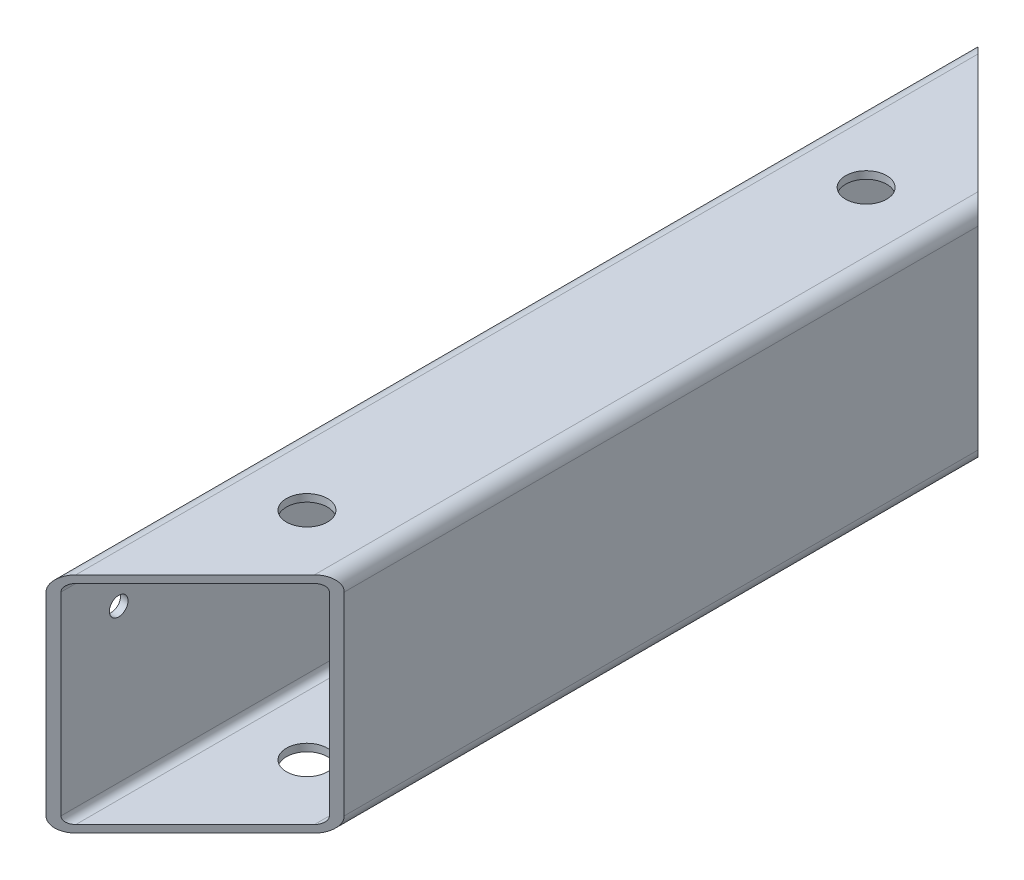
ISO-10303-21;
HEADER;
FILE_DESCRIPTION(('STEP AP214'),'2;1');
FILE_NAME('part.step','',(''),(''),'','','');
FILE_SCHEMA(('AUTOMOTIVE_DESIGN { 1 0 10303 214 1 1 1 1 }'));
ENDSEC;
DATA;
#1=APPLICATION_CONTEXT('core data for automotive mechanical design processes');
#2=APPLICATION_PROTOCOL_DEFINITION('international standard','automotive_design',2000,#1);
#3=PRODUCT_CONTEXT('',#1,'mechanical');
#4=PRODUCT('Part','Part','',(#3));
#5=PRODUCT_RELATED_PRODUCT_CATEGORY('part','',(#4));
#6=PRODUCT_DEFINITION_FORMATION('','',#4);
#7=PRODUCT_DEFINITION_CONTEXT('part definition',#1,'design');
#8=PRODUCT_DEFINITION('design','',#6,#7);
#9=PRODUCT_DEFINITION_SHAPE('','',#8);
#10=(LENGTH_UNIT() NAMED_UNIT(*) SI_UNIT(.MILLI.,.METRE.));
#11=(NAMED_UNIT(*) PLANE_ANGLE_UNIT() SI_UNIT($,.RADIAN.));
#12=(NAMED_UNIT(*) SI_UNIT($,.STERADIAN.) SOLID_ANGLE_UNIT());
#13=UNCERTAINTY_MEASURE_WITH_UNIT(LENGTH_MEASURE(1.E-05),#10,'distance_accuracy_value','');
#14=(GEOMETRIC_REPRESENTATION_CONTEXT(3) GLOBAL_UNCERTAINTY_ASSIGNED_CONTEXT((#13)) GLOBAL_UNIT_ASSIGNED_CONTEXT((#10,
#11,#12)) REPRESENTATION_CONTEXT('',''));
#15=CARTESIAN_POINT('',(0.,0.,0.));
#16=DIRECTION('',(0.,0.,1.));
#17=DIRECTION('',(1.,0.,0.));
#18=AXIS2_PLACEMENT_3D('',#15,#16,#17);
#19=CARTESIAN_POINT('',(-16.,26.,125.));
#20=DIRECTION('',(0.,0.,-1.));
#21=DIRECTION('',(-1.,0.,0.));
#22=AXIS2_PLACEMENT_3D('',#19,#20,#21);
#23=CYLINDRICAL_SURFACE('',#22,4.);
#24=DIRECTION('',(0.,0.,-1.));
#25=VECTOR('',#24,1.);
#26=CARTESIAN_POINT('',(-20.,26.,125.));
#27=LINE('',#26,#25);
#28=CARTESIAN_POINT('',(-20.,26.,125.));
#29=VERTEX_POINT('',#28);
#30=CARTESIAN_POINT('',(-20.,26.,-125.));
#31=VERTEX_POINT('',#30);
#32=EDGE_CURVE('E154',#29,#31,#27,.T.);
#33=ORIENTED_EDGE('',*,*,#32,.F.);
#34=CARTESIAN_POINT('',(-16.,26.,121.));
#35=DIRECTION('',(-0.707106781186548,0.,-0.707106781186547));
#36=DIRECTION('',(0.707106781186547,0.,-0.707106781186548));
#37=AXIS2_PLACEMENT_3D('',#34,#35,#36);
#38=ELLIPSE('',#37,5.65685424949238,4.);
#39=CARTESIAN_POINT('',(-16.,30.,121.));
#40=VERTEX_POINT('',#39);
#41=EDGE_CURVE('E140',#29,#40,#38,.T.);
#42=ORIENTED_EDGE('',*,*,#41,.T.);
#43=DIRECTION('',(0.,0.,-1.));
#44=VECTOR('',#43,1.);
#45=CARTESIAN_POINT('',(-16.,30.,125.));
#46=LINE('',#45,#44);
#47=CARTESIAN_POINT('',(-16.,30.,-121.));
#48=VERTEX_POINT('',#47);
#49=EDGE_CURVE('E151',#40,#48,#46,.T.);
#50=ORIENTED_EDGE('',*,*,#49,.T.);
#51=CARTESIAN_POINT('',(-16.,26.,-121.));
#52=DIRECTION('',(-0.707106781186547,0.,0.707106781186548));
#53=DIRECTION('',(-0.707106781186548,0.,-0.707106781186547));
#54=AXIS2_PLACEMENT_3D('',#51,#52,#53);
#55=ELLIPSE('',#54,5.65685424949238,4.);
#56=EDGE_CURVE('E277',#48,#31,#55,.T.);
#57=ORIENTED_EDGE('',*,*,#56,.T.);
#58=EDGE_LOOP('',(#33,#42,#50,#57));
#59=FACE_BOUND('',#58,.T.);
#60=ADVANCED_FACE('F27',(#59),#23,.T.);
#61=CARTESIAN_POINT('',(-20.,-26.,125.));
#62=DIRECTION('',(1.,0.,0.));
#63=DIRECTION('',(0.,1.,0.));
#64=AXIS2_PLACEMENT_3D('',#61,#62,#63);
#65=PLANE('',#64);
#66=CARTESIAN_POINT('',(-20.,15.,-107.5));
#67=DIRECTION('',(-1.,0.,0.));
#68=DIRECTION('',(0.,1.,0.));
#69=AXIS2_PLACEMENT_3D('',#66,#67,#68);
#70=CIRCLE('',#69,2.50000000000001);
#71=CARTESIAN_POINT('',(-20.,12.5,-107.5));
#72=VERTEX_POINT('',#71);
#73=EDGE_CURVE('E201',#72,#72,#70,.T.);
#74=ORIENTED_EDGE('',*,*,#73,.F.);
#75=EDGE_LOOP('',(#74));
#76=FACE_BOUND('',#75,.T.);
#77=CARTESIAN_POINT('',(-20.,15.,107.5));
#78=DIRECTION('',(-1.,0.,0.));
#79=DIRECTION('',(0.,-1.,0.));
#80=AXIS2_PLACEMENT_3D('',#77,#78,#79);
#81=CIRCLE('',#80,2.50000000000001);
#82=CARTESIAN_POINT('',(-20.,12.5,107.5));
#83=VERTEX_POINT('',#82);
#84=EDGE_CURVE('E207',#83,#83,#81,.T.);
#85=ORIENTED_EDGE('',*,*,#84,.F.);
#86=EDGE_LOOP('',(#85));
#87=FACE_BOUND('',#86,.T.);
#88=CARTESIAN_POINT('',(-20.,-15.,0.));
#89=DIRECTION('',(-1.,0.,0.));
#90=DIRECTION('',(0.,-1.,0.));
#91=AXIS2_PLACEMENT_3D('',#88,#89,#90);
#92=CIRCLE('',#91,2.5);
#93=CARTESIAN_POINT('',(-20.,-17.5,0.));
#94=VERTEX_POINT('',#93);
#95=EDGE_CURVE('E146',#94,#94,#92,.T.);
#96=ORIENTED_EDGE('',*,*,#95,.F.);
#97=EDGE_LOOP('',(#96));
#98=FACE_BOUND('',#97,.T.);
#99=DIRECTION('',(0.,-1.,0.));
#100=VECTOR('',#99,1.);
#101=CARTESIAN_POINT('',(-20.,-26.,-125.));
#102=LINE('',#101,#100);
#103=CARTESIAN_POINT('',(-20.,-26.,-125.));
#104=VERTEX_POINT('',#103);
#105=EDGE_CURVE('E166',#31,#104,#102,.T.);
#106=ORIENTED_EDGE('',*,*,#105,.T.);
#107=DIRECTION('',(0.,0.,-1.));
#108=VECTOR('',#107,1.);
#109=CARTESIAN_POINT('',(-20.,-26.,125.));
#110=LINE('',#109,#108);
#111=CARTESIAN_POINT('',(-20.,-26.,125.));
#112=VERTEX_POINT('',#111);
#113=EDGE_CURVE('E177',#112,#104,#110,.T.);
#114=ORIENTED_EDGE('',*,*,#113,.F.);
#115=DIRECTION('',(0.,-1.,0.));
#116=VECTOR('',#115,1.);
#117=CARTESIAN_POINT('',(-20.,-26.,125.));
#118=LINE('',#117,#116);
#119=EDGE_CURVE('E162',#29,#112,#118,.T.);
#120=ORIENTED_EDGE('',*,*,#119,.F.);
#121=ORIENTED_EDGE('',*,*,#32,.T.);
#122=EDGE_LOOP('',(#106,#114,#120,#121));
#123=FACE_BOUND('',#122,.T.);
#124=ADVANCED_FACE('F297',(#76,#87,#98,#123),#65,.F.);
#125=CARTESIAN_POINT('',(-16.,-26.,125.));
#126=DIRECTION('',(0.,0.,-1.));
#127=DIRECTION('',(-1.,0.,0.));
#128=AXIS2_PLACEMENT_3D('',#125,#126,#127);
#129=CYLINDRICAL_SURFACE('',#128,4.);
#130=DIRECTION('',(0.,0.,-1.));
#131=VECTOR('',#130,1.);
#132=CARTESIAN_POINT('',(-16.,-30.,125.));
#133=LINE('',#132,#131);
#134=CARTESIAN_POINT('',(-16.,-30.,121.));
#135=VERTEX_POINT('',#134);
#136=CARTESIAN_POINT('',(-16.,-30.,-121.));
#137=VERTEX_POINT('',#136);
#138=EDGE_CURVE('E175',#135,#137,#133,.T.);
#139=ORIENTED_EDGE('',*,*,#138,.F.);
#140=CARTESIAN_POINT('',(-16.,-26.,121.));
#141=DIRECTION('',(-0.707106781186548,0.,-0.707106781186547));
#142=DIRECTION('',(0.707106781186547,0.,-0.707106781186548));
#143=AXIS2_PLACEMENT_3D('',#140,#141,#142);
#144=ELLIPSE('',#143,5.65685424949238,4.);
#145=EDGE_CURVE('E156',#135,#112,#144,.T.);
#146=ORIENTED_EDGE('',*,*,#145,.T.);
#147=ORIENTED_EDGE('',*,*,#113,.T.);
#148=CARTESIAN_POINT('',(-16.,-26.,-121.));
#149=DIRECTION('',(-0.707106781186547,0.,0.707106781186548));
#150=DIRECTION('',(-0.707106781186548,0.,-0.707106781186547));
#151=AXIS2_PLACEMENT_3D('',#148,#149,#150);
#152=ELLIPSE('',#151,5.65685424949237,4.);
#153=EDGE_CURVE('E274',#104,#137,#152,.T.);
#154=ORIENTED_EDGE('',*,*,#153,.T.);
#155=EDGE_LOOP('',(#139,#146,#147,#154));
#156=FACE_BOUND('',#155,.T.);
#157=ADVANCED_FACE('F301',(#156),#129,.T.);
#158=CARTESIAN_POINT('',(-16.,-30.,125.));
#159=DIRECTION('',(0.,1.,0.));
#160=DIRECTION('',(-1.,0.,0.));
#161=AXIS2_PLACEMENT_3D('',#158,#159,#160);
#162=PLANE('',#161);
#163=CARTESIAN_POINT('',(0.,-30.,-75.));
#164=DIRECTION('',(0.,1.,0.));
#165=DIRECTION('',(0.,0.,-1.));
#166=AXIS2_PLACEMENT_3D('',#163,#164,#165);
#167=CIRCLE('',#166,5.49999999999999);
#168=CARTESIAN_POINT('',(0.,-30.,-69.5));
#169=VERTEX_POINT('',#168);
#170=EDGE_CURVE('E505',#169,#169,#167,.T.);
#171=ORIENTED_EDGE('',*,*,#170,.T.);
#172=EDGE_LOOP('',(#171));
#173=FACE_BOUND('',#172,.T.);
#174=CARTESIAN_POINT('',(0.,-30.,75.));
#175=DIRECTION('',(0.,1.,0.));
#176=DIRECTION('',(0.,0.,1.));
#177=AXIS2_PLACEMENT_3D('',#174,#175,#176);
#178=CIRCLE('',#177,5.5);
#179=CARTESIAN_POINT('',(0.,-30.,80.5));
#180=VERTEX_POINT('',#179);
#181=EDGE_CURVE('E185',#180,#180,#178,.T.);
#182=ORIENTED_EDGE('',*,*,#181,.T.);
#183=EDGE_LOOP('',(#182));
#184=FACE_BOUND('',#183,.T.);
#185=DIRECTION('',(0.,0.,-1.));
#186=VECTOR('',#185,1.);
#187=CARTESIAN_POINT('',(16.,-30.,125.));
#188=LINE('',#187,#186);
#189=CARTESIAN_POINT('',(16.,-30.,88.9999999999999));
#190=VERTEX_POINT('',#189);
#191=CARTESIAN_POINT('',(16.,-30.,-89.));
#192=VERTEX_POINT('',#191);
#193=EDGE_CURVE('E173',#190,#192,#188,.T.);
#194=ORIENTED_EDGE('',*,*,#193,.F.);
#195=DIRECTION('',(-0.707106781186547,0.,0.707106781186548));
#196=VECTOR('',#195,1.);
#197=CARTESIAN_POINT('',(-20.,-30.,125.));
#198=LINE('',#197,#196);
#199=EDGE_CURVE('E145',#190,#135,#198,.T.);
#200=ORIENTED_EDGE('',*,*,#199,.T.);
#201=ORIENTED_EDGE('',*,*,#138,.T.);
#202=DIRECTION('',(0.707106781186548,0.,0.707106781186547));
#203=VECTOR('',#202,1.);
#204=CARTESIAN_POINT('',(-20.,-30.,-125.));
#205=LINE('',#204,#203);
#206=EDGE_CURVE('E241',#137,#192,#205,.T.);
#207=ORIENTED_EDGE('',*,*,#206,.T.);
#208=EDGE_LOOP('',(#194,#200,#201,#207));
#209=FACE_BOUND('',#208,.T.);
#210=ADVANCED_FACE('F304',(#173,#184,#209),#162,.F.);
#211=CARTESIAN_POINT('',(16.,-26.,125.));
#212=DIRECTION('',(0.,0.,-1.));
#213=DIRECTION('',(-1.,0.,0.));
#214=AXIS2_PLACEMENT_3D('',#211,#212,#213);
#215=CYLINDRICAL_SURFACE('',#214,4.);
#216=DIRECTION('',(0.,0.,-1.));
#217=VECTOR('',#216,1.);
#218=CARTESIAN_POINT('',(20.,-26.,125.));
#219=LINE('',#218,#217);
#220=CARTESIAN_POINT('',(20.,-26.,85.));
#221=VERTEX_POINT('',#220);
#222=CARTESIAN_POINT('',(20.,-26.,-85.));
#223=VERTEX_POINT('',#222);
#224=EDGE_CURVE('E171',#221,#223,#219,.T.);
#225=ORIENTED_EDGE('',*,*,#224,.F.);
#226=CARTESIAN_POINT('',(16.,-26.,88.9999999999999));
#227=DIRECTION('',(-0.707106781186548,0.,-0.707106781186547));
#228=DIRECTION('',(0.707106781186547,0.,-0.707106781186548));
#229=AXIS2_PLACEMENT_3D('',#226,#227,#228);
#230=ELLIPSE('',#229,5.65685424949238,4.);
#231=EDGE_CURVE('E235',#221,#190,#230,.T.);
#232=ORIENTED_EDGE('',*,*,#231,.T.);
#233=ORIENTED_EDGE('',*,*,#193,.T.);
#234=CARTESIAN_POINT('',(16.,-26.,-89.));
#235=DIRECTION('',(-0.707106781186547,0.,0.707106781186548));
#236=DIRECTION('',(-0.707106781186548,0.,-0.707106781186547));
#237=AXIS2_PLACEMENT_3D('',#234,#235,#236);
#238=ELLIPSE('',#237,5.65685424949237,4.);
#239=EDGE_CURVE('E271',#192,#223,#238,.T.);
#240=ORIENTED_EDGE('',*,*,#239,.T.);
#241=EDGE_LOOP('',(#225,#232,#233,#240));
#242=FACE_BOUND('',#241,.T.);
#243=ADVANCED_FACE('F309',(#242),#215,.T.);
#244=CARTESIAN_POINT('',(20.,-26.,125.));
#245=DIRECTION('',(-1.,0.,0.));
#246=DIRECTION('',(0.,0.,1.));
#247=AXIS2_PLACEMENT_3D('',#244,#245,#246);
#248=PLANE('',#247);
#249=DIRECTION('',(0.,0.,-1.));
#250=VECTOR('',#249,1.);
#251=CARTESIAN_POINT('',(20.,26.,125.));
#252=LINE('',#251,#250);
#253=CARTESIAN_POINT('',(20.,26.,85.));
#254=VERTEX_POINT('',#253);
#255=CARTESIAN_POINT('',(20.,26.,-85.));
#256=VERTEX_POINT('',#255);
#257=EDGE_CURVE('E164',#254,#256,#252,.T.);
#258=ORIENTED_EDGE('',*,*,#257,.F.);
#259=DIRECTION('',(0.,1.,0.));
#260=VECTOR('',#259,1.);
#261=CARTESIAN_POINT('',(20.,-30.,85.));
#262=LINE('',#261,#260);
#263=EDGE_CURVE('E219',#221,#254,#262,.T.);
#264=ORIENTED_EDGE('',*,*,#263,.F.);
#265=ORIENTED_EDGE('',*,*,#224,.T.);
#266=DIRECTION('',(0.,1.,0.));
#267=VECTOR('',#266,1.);
#268=CARTESIAN_POINT('',(20.,-30.,-85.));
#269=LINE('',#268,#267);
#270=EDGE_CURVE('E244',#223,#256,#269,.T.);
#271=ORIENTED_EDGE('',*,*,#270,.T.);
#272=EDGE_LOOP('',(#258,#264,#265,#271));
#273=FACE_BOUND('',#272,.T.);
#274=ADVANCED_FACE('F315',(#273),#248,.F.);
#275=CARTESIAN_POINT('',(16.,26.,125.));
#276=DIRECTION('',(0.,0.,-1.));
#277=DIRECTION('',(-1.,0.,0.));
#278=AXIS2_PLACEMENT_3D('',#275,#276,#277);
#279=CYLINDRICAL_SURFACE('',#278,4.);
#280=DIRECTION('',(0.,0.,-1.));
#281=VECTOR('',#280,1.);
#282=CARTESIAN_POINT('',(16.,30.,125.));
#283=LINE('',#282,#281);
#284=CARTESIAN_POINT('',(16.,30.,89.));
#285=VERTEX_POINT('',#284);
#286=CARTESIAN_POINT('',(16.,30.,-89.));
#287=VERTEX_POINT('',#286);
#288=EDGE_CURVE('E161',#285,#287,#283,.T.);
#289=ORIENTED_EDGE('',*,*,#288,.F.);
#290=CARTESIAN_POINT('',(16.,26.,89.));
#291=DIRECTION('',(-0.707106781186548,0.,-0.707106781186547));
#292=DIRECTION('',(0.707106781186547,0.,-0.707106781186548));
#293=AXIS2_PLACEMENT_3D('',#290,#291,#292);
#294=ELLIPSE('',#293,5.65685424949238,4.);
#295=EDGE_CURVE('E43',#285,#254,#294,.T.);
#296=ORIENTED_EDGE('',*,*,#295,.T.);
#297=ORIENTED_EDGE('',*,*,#257,.T.);
#298=CARTESIAN_POINT('',(16.,26.,-89.));
#299=DIRECTION('',(-0.707106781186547,0.,0.707106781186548));
#300=DIRECTION('',(-0.707106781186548,0.,-0.707106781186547));
#301=AXIS2_PLACEMENT_3D('',#298,#299,#300);
#302=ELLIPSE('',#301,5.65685424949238,4.);
#303=EDGE_CURVE('E268',#256,#287,#302,.T.);
#304=ORIENTED_EDGE('',*,*,#303,.T.);
#305=EDGE_LOOP('',(#289,#296,#297,#304));
#306=FACE_BOUND('',#305,.T.);
#307=ADVANCED_FACE('F318',(#306),#279,.T.);
#308=CARTESIAN_POINT('',(-16.,30.,125.));
#309=DIRECTION('',(0.,-1.,0.));
#310=DIRECTION('',(1.,0.,0.));
#311=AXIS2_PLACEMENT_3D('',#308,#309,#310);
#312=PLANE('',#311);
#313=CARTESIAN_POINT('',(0.,30.,-75.));
#314=DIRECTION('',(0.,1.,0.));
#315=DIRECTION('',(0.,0.,-1.));
#316=AXIS2_PLACEMENT_3D('',#313,#314,#315);
#317=CIRCLE('',#316,5.49999999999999);
#318=CARTESIAN_POINT('',(0.,30.,-69.5));
#319=VERTEX_POINT('',#318);
#320=EDGE_CURVE('E506',#319,#319,#317,.T.);
#321=ORIENTED_EDGE('',*,*,#320,.F.);
#322=EDGE_LOOP('',(#321));
#323=FACE_BOUND('',#322,.T.);
#324=CARTESIAN_POINT('',(0.,30.,75.));
#325=DIRECTION('',(0.,1.,0.));
#326=DIRECTION('',(0.,0.,1.));
#327=AXIS2_PLACEMENT_3D('',#324,#325,#326);
#328=CIRCLE('',#327,5.5);
#329=CARTESIAN_POINT('',(0.,30.,80.5));
#330=VERTEX_POINT('',#329);
#331=EDGE_CURVE('E192',#330,#330,#328,.T.);
#332=ORIENTED_EDGE('',*,*,#331,.F.);
#333=EDGE_LOOP('',(#332));
#334=FACE_BOUND('',#333,.T.);
#335=ORIENTED_EDGE('',*,*,#49,.F.);
#336=DIRECTION('',(-0.707106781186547,0.,0.707106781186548));
#337=VECTOR('',#336,1.);
#338=CARTESIAN_POINT('',(-20.,30.,125.));
#339=LINE('',#338,#337);
#340=EDGE_CURVE('E137',#285,#40,#339,.T.);
#341=ORIENTED_EDGE('',*,*,#340,.F.);
#342=ORIENTED_EDGE('',*,*,#288,.T.);
#343=DIRECTION('',(0.707106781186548,0.,0.707106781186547));
#344=VECTOR('',#343,1.);
#345=CARTESIAN_POINT('',(-20.,30.,-125.));
#346=LINE('',#345,#344);
#347=EDGE_CURVE('E155',#48,#287,#346,.T.);
#348=ORIENTED_EDGE('',*,*,#347,.F.);
#349=EDGE_LOOP('',(#335,#341,#342,#348));
#350=FACE_BOUND('',#349,.T.);
#351=ADVANCED_FACE('F159',(#323,#334,#350),#312,.F.);
#352=CARTESIAN_POINT('',(-16.,26.,125.));
#353=DIRECTION('',(0.,0.,-1.));
#354=DIRECTION('',(-1.,0.,0.));
#355=AXIS2_PLACEMENT_3D('',#352,#353,#354);
#356=CYLINDRICAL_SURFACE('',#355,2.);
#357=CARTESIAN_POINT('',(-16.,26.,121.));
#358=DIRECTION('',(-0.707106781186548,0.,-0.707106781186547));
#359=DIRECTION('',(0.707106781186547,0.,-0.707106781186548));
#360=AXIS2_PLACEMENT_3D('',#357,#358,#359);
#361=ELLIPSE('',#360,2.82842712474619,2.);
#362=CARTESIAN_POINT('',(-18.,26.,123.));
#363=VERTEX_POINT('',#362);
#364=CARTESIAN_POINT('',(-16.,28.,121.));
#365=VERTEX_POINT('',#364);
#366=EDGE_CURVE('E50',#363,#365,#361,.T.);
#367=ORIENTED_EDGE('',*,*,#366,.F.);
#368=DIRECTION('',(0.,0.,-1.));
#369=VECTOR('',#368,1.);
#370=CARTESIAN_POINT('',(-18.,26.,125.));
#371=LINE('',#370,#369);
#372=CARTESIAN_POINT('',(-18.,26.,-123.));
#373=VERTEX_POINT('',#372);
#374=EDGE_CURVE('E293',#363,#373,#371,.T.);
#375=ORIENTED_EDGE('',*,*,#374,.T.);
#376=CARTESIAN_POINT('',(-16.,26.,-121.));
#377=DIRECTION('',(-0.707106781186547,0.,0.707106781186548));
#378=DIRECTION('',(-0.707106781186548,0.,-0.707106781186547));
#379=AXIS2_PLACEMENT_3D('',#376,#377,#378);
#380=ELLIPSE('',#379,2.82842712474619,2.);
#381=CARTESIAN_POINT('',(-16.,28.,-121.));
#382=VERTEX_POINT('',#381);
#383=EDGE_CURVE('E265',#382,#373,#380,.T.);
#384=ORIENTED_EDGE('',*,*,#383,.F.);
#385=DIRECTION('',(0.,0.,-1.));
#386=VECTOR('',#385,1.);
#387=CARTESIAN_POINT('',(-16.,28.,125.));
#388=LINE('',#387,#386);
#389=EDGE_CURVE('E279',#365,#382,#388,.T.);
#390=ORIENTED_EDGE('',*,*,#389,.F.);
#391=EDGE_LOOP('',(#367,#375,#384,#390));
#392=FACE_BOUND('',#391,.T.);
#393=ADVANCED_FACE('F325',(#392),#356,.F.);
#394=CARTESIAN_POINT('',(-18.,-26.,125.));
#395=DIRECTION('',(1.,0.,0.));
#396=DIRECTION('',(0.,1.,0.));
#397=AXIS2_PLACEMENT_3D('',#394,#395,#396);
#398=PLANE('',#397);
#399=CARTESIAN_POINT('',(-18.,15.,-107.5));
#400=DIRECTION('',(1.,0.,0.));
#401=DIRECTION('',(0.,1.,0.));
#402=AXIS2_PLACEMENT_3D('',#399,#400,#401);
#403=CIRCLE('',#402,2.50000000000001);
#404=CARTESIAN_POINT('',(-18.,12.5,-107.5));
#405=VERTEX_POINT('',#404);
#406=EDGE_CURVE('E189',#405,#405,#403,.F.);
#407=ORIENTED_EDGE('',*,*,#406,.T.);
#408=EDGE_LOOP('',(#407));
#409=FACE_BOUND('',#408,.T.);
#410=CARTESIAN_POINT('',(-18.,15.,107.5));
#411=DIRECTION('',(1.,0.,0.));
#412=DIRECTION('',(0.,1.,0.));
#413=AXIS2_PLACEMENT_3D('',#410,#411,#412);
#414=CIRCLE('',#413,2.50000000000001);
#415=CARTESIAN_POINT('',(-18.,12.5,107.5));
#416=VERTEX_POINT('',#415);
#417=EDGE_CURVE('E204',#416,#416,#414,.F.);
#418=ORIENTED_EDGE('',*,*,#417,.T.);
#419=EDGE_LOOP('',(#418));
#420=FACE_BOUND('',#419,.T.);
#421=CARTESIAN_POINT('',(-18.,-15.,0.));
#422=DIRECTION('',(1.,0.,0.));
#423=DIRECTION('',(0.,1.,0.));
#424=AXIS2_PLACEMENT_3D('',#421,#422,#423);
#425=CIRCLE('',#424,2.5);
#426=CARTESIAN_POINT('',(-18.,-17.5,0.));
#427=VERTEX_POINT('',#426);
#428=EDGE_CURVE('E210',#427,#427,#425,.F.);
#429=ORIENTED_EDGE('',*,*,#428,.T.);
#430=EDGE_LOOP('',(#429));
#431=FACE_BOUND('',#430,.T.);
#432=DIRECTION('',(0.,1.,0.));
#433=VECTOR('',#432,1.);
#434=CARTESIAN_POINT('',(-18.,-26.,123.));
#435=LINE('',#434,#433);
#436=CARTESIAN_POINT('',(-18.,-26.,123.));
#437=VERTEX_POINT('',#436);
#438=EDGE_CURVE('E231',#437,#363,#435,.T.);
#439=ORIENTED_EDGE('',*,*,#438,.F.);
#440=DIRECTION('',(0.,0.,-1.));
#441=VECTOR('',#440,1.);
#442=CARTESIAN_POINT('',(-18.,-26.,125.));
#443=LINE('',#442,#441);
#444=CARTESIAN_POINT('',(-18.,-26.,-123.));
#445=VERTEX_POINT('',#444);
#446=EDGE_CURVE('E291',#437,#445,#443,.T.);
#447=ORIENTED_EDGE('',*,*,#446,.T.);
#448=DIRECTION('',(0.,-1.,0.));
#449=VECTOR('',#448,1.);
#450=CARTESIAN_POINT('',(-18.,-26.0000000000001,-123.));
#451=LINE('',#450,#449);
#452=EDGE_CURVE('E262',#373,#445,#451,.T.);
#453=ORIENTED_EDGE('',*,*,#452,.F.);
#454=ORIENTED_EDGE('',*,*,#374,.F.);
#455=EDGE_LOOP('',(#439,#447,#453,#454));
#456=FACE_BOUND('',#455,.T.);
#457=ADVANCED_FACE('F376',(#409,#420,#431,#456),#398,.T.);
#458=CARTESIAN_POINT('',(-16.,-26.,125.));
#459=DIRECTION('',(0.,0.,-1.));
#460=DIRECTION('',(-1.,0.,0.));
#461=AXIS2_PLACEMENT_3D('',#458,#459,#460);
#462=CYLINDRICAL_SURFACE('',#461,2.);
#463=CARTESIAN_POINT('',(-16.,-26.,121.));
#464=DIRECTION('',(-0.707106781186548,0.,-0.707106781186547));
#465=DIRECTION('',(0.707106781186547,0.,-0.707106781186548));
#466=AXIS2_PLACEMENT_3D('',#463,#464,#465);
#467=ELLIPSE('',#466,2.82842712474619,2.);
#468=CARTESIAN_POINT('',(-16.,-28.,121.));
#469=VERTEX_POINT('',#468);
#470=EDGE_CURVE('E229',#469,#437,#467,.T.);
#471=ORIENTED_EDGE('',*,*,#470,.F.);
#472=DIRECTION('',(0.,0.,-1.));
#473=VECTOR('',#472,1.);
#474=CARTESIAN_POINT('',(-16.,-28.,125.));
#475=LINE('',#474,#473);
#476=CARTESIAN_POINT('',(-16.,-28.,-121.));
#477=VERTEX_POINT('',#476);
#478=EDGE_CURVE('E289',#469,#477,#475,.T.);
#479=ORIENTED_EDGE('',*,*,#478,.T.);
#480=CARTESIAN_POINT('',(-16.,-26.,-121.));
#481=DIRECTION('',(-0.707106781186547,0.,0.707106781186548));
#482=DIRECTION('',(-0.707106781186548,0.,-0.707106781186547));
#483=AXIS2_PLACEMENT_3D('',#480,#481,#482);
#484=ELLIPSE('',#483,2.82842712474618,2.);
#485=EDGE_CURVE('E259',#445,#477,#484,.T.);
#486=ORIENTED_EDGE('',*,*,#485,.F.);
#487=ORIENTED_EDGE('',*,*,#446,.F.);
#488=EDGE_LOOP('',(#471,#479,#486,#487));
#489=FACE_BOUND('',#488,.T.);
#490=ADVANCED_FACE('F385',(#489),#462,.F.);
#491=CARTESIAN_POINT('',(-16.,-28.,125.));
#492=DIRECTION('',(0.,1.,0.));
#493=DIRECTION('',(-1.,0.,0.));
#494=AXIS2_PLACEMENT_3D('',#491,#492,#493);
#495=PLANE('',#494);
#496=CARTESIAN_POINT('',(0.,-28.,-75.));
#497=DIRECTION('',(0.,1.,0.));
#498=DIRECTION('',(-1.,0.,0.));
#499=AXIS2_PLACEMENT_3D('',#496,#497,#498);
#500=CIRCLE('',#499,5.49999999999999);
#501=CARTESIAN_POINT('',(0.,-28.,-69.5));
#502=VERTEX_POINT('',#501);
#503=EDGE_CURVE('E197',#502,#502,#500,.T.);
#504=ORIENTED_EDGE('',*,*,#503,.F.);
#505=EDGE_LOOP('',(#504));
#506=FACE_BOUND('',#505,.T.);
#507=CARTESIAN_POINT('',(0.,-28.,75.));
#508=DIRECTION('',(0.,1.,0.));
#509=DIRECTION('',(-1.,0.,0.));
#510=AXIS2_PLACEMENT_3D('',#507,#508,#509);
#511=CIRCLE('',#510,5.5);
#512=CARTESIAN_POINT('',(0.,-28.,80.5));
#513=VERTEX_POINT('',#512);
#514=EDGE_CURVE('E184',#513,#513,#511,.T.);
#515=ORIENTED_EDGE('',*,*,#514,.F.);
#516=EDGE_LOOP('',(#515));
#517=FACE_BOUND('',#516,.T.);
#518=DIRECTION('',(-0.707106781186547,0.,0.707106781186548));
#519=VECTOR('',#518,1.);
#520=CARTESIAN_POINT('',(-18.,-28.,123.));
#521=LINE('',#520,#519);
#522=CARTESIAN_POINT('',(16.,-28.,88.9999999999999));
#523=VERTEX_POINT('',#522);
#524=EDGE_CURVE('E227',#523,#469,#521,.T.);
#525=ORIENTED_EDGE('',*,*,#524,.F.);
#526=DIRECTION('',(0.,0.,-1.));
#527=VECTOR('',#526,1.);
#528=CARTESIAN_POINT('',(16.,-28.,125.));
#529=LINE('',#528,#527);
#530=CARTESIAN_POINT('',(16.,-28.,-89.));
#531=VERTEX_POINT('',#530);
#532=EDGE_CURVE('E287',#523,#531,#529,.T.);
#533=ORIENTED_EDGE('',*,*,#532,.T.);
#534=DIRECTION('',(0.707106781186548,0.,0.707106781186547));
#535=VECTOR('',#534,1.);
#536=CARTESIAN_POINT('',(107.,-28.,1.99999999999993));
#537=LINE('',#536,#535);
#538=EDGE_CURVE('E256',#477,#531,#537,.T.);
#539=ORIENTED_EDGE('',*,*,#538,.F.);
#540=ORIENTED_EDGE('',*,*,#478,.F.);
#541=EDGE_LOOP('',(#525,#533,#539,#540));
#542=FACE_BOUND('',#541,.T.);
#543=ADVANCED_FACE('F393',(#506,#517,#542),#495,.T.);
#544=CARTESIAN_POINT('',(16.,-26.,125.));
#545=DIRECTION('',(0.,0.,-1.));
#546=DIRECTION('',(-1.,0.,0.));
#547=AXIS2_PLACEMENT_3D('',#544,#545,#546);
#548=CYLINDRICAL_SURFACE('',#547,2.);
#549=CARTESIAN_POINT('',(16.,-26.,88.9999999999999));
#550=DIRECTION('',(-0.707106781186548,0.,-0.707106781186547));
#551=DIRECTION('',(0.707106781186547,0.,-0.707106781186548));
#552=AXIS2_PLACEMENT_3D('',#549,#550,#551);
#553=ELLIPSE('',#552,2.82842712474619,2.);
#554=CARTESIAN_POINT('',(18.,-26.,86.9999999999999));
#555=VERTEX_POINT('',#554);
#556=EDGE_CURVE('E225',#555,#523,#553,.T.);
#557=ORIENTED_EDGE('',*,*,#556,.F.);
#558=DIRECTION('',(0.,0.,-1.));
#559=VECTOR('',#558,1.);
#560=CARTESIAN_POINT('',(18.,-26.,125.));
#561=LINE('',#560,#559);
#562=CARTESIAN_POINT('',(18.,-26.,-87.));
#563=VERTEX_POINT('',#562);
#564=EDGE_CURVE('E285',#555,#563,#561,.T.);
#565=ORIENTED_EDGE('',*,*,#564,.T.);
#566=CARTESIAN_POINT('',(16.,-26.,-89.));
#567=DIRECTION('',(-0.707106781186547,0.,0.707106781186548));
#568=DIRECTION('',(-0.707106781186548,0.,-0.707106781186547));
#569=AXIS2_PLACEMENT_3D('',#566,#567,#568);
#570=ELLIPSE('',#569,2.82842712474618,2.);
#571=EDGE_CURVE('E253',#531,#563,#570,.T.);
#572=ORIENTED_EDGE('',*,*,#571,.F.);
#573=ORIENTED_EDGE('',*,*,#532,.F.);
#574=EDGE_LOOP('',(#557,#565,#572,#573));
#575=FACE_BOUND('',#574,.T.);
#576=ADVANCED_FACE('F401',(#575),#548,.F.);
#577=CARTESIAN_POINT('',(18.,-26.,125.));
#578=DIRECTION('',(-1.,0.,0.));
#579=DIRECTION('',(0.,0.,1.));
#580=AXIS2_PLACEMENT_3D('',#577,#578,#579);
#581=PLANE('',#580);
#582=DIRECTION('',(0.,-1.,0.));
#583=VECTOR('',#582,1.);
#584=CARTESIAN_POINT('',(18.,-26.,86.9999999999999));
#585=LINE('',#584,#583);
#586=CARTESIAN_POINT('',(18.,26.,86.9999999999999));
#587=VERTEX_POINT('',#586);
#588=EDGE_CURVE('E223',#587,#555,#585,.T.);
#589=ORIENTED_EDGE('',*,*,#588,.F.);
#590=DIRECTION('',(0.,0.,-1.));
#591=VECTOR('',#590,1.);
#592=CARTESIAN_POINT('',(18.,26.,125.));
#593=LINE('',#592,#591);
#594=CARTESIAN_POINT('',(18.,26.,-87.));
#595=VERTEX_POINT('',#594);
#596=EDGE_CURVE('E283',#587,#595,#593,.T.);
#597=ORIENTED_EDGE('',*,*,#596,.T.);
#598=DIRECTION('',(0.,1.,0.));
#599=VECTOR('',#598,1.);
#600=CARTESIAN_POINT('',(18.,-26.,-87.));
#601=LINE('',#600,#599);
#602=EDGE_CURVE('E250',#563,#595,#601,.T.);
#603=ORIENTED_EDGE('',*,*,#602,.F.);
#604=ORIENTED_EDGE('',*,*,#564,.F.);
#605=EDGE_LOOP('',(#589,#597,#603,#604));
#606=FACE_BOUND('',#605,.T.);
#607=ADVANCED_FACE('F409',(#606),#581,.T.);
#608=CARTESIAN_POINT('',(16.,26.,125.));
#609=DIRECTION('',(0.,0.,-1.));
#610=DIRECTION('',(-1.,0.,0.));
#611=AXIS2_PLACEMENT_3D('',#608,#609,#610);
#612=CYLINDRICAL_SURFACE('',#611,2.);
#613=CARTESIAN_POINT('',(16.,26.,89.));
#614=DIRECTION('',(-0.707106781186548,0.,-0.707106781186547));
#615=DIRECTION('',(0.707106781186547,0.,-0.707106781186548));
#616=AXIS2_PLACEMENT_3D('',#613,#614,#615);
#617=ELLIPSE('',#616,2.82842712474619,2.);
#618=CARTESIAN_POINT('',(16.,28.,89.));
#619=VERTEX_POINT('',#618);
#620=EDGE_CURVE('E221',#619,#587,#617,.T.);
#621=ORIENTED_EDGE('',*,*,#620,.F.);
#622=DIRECTION('',(0.,0.,-1.));
#623=VECTOR('',#622,1.);
#624=CARTESIAN_POINT('',(16.,28.,125.));
#625=LINE('',#624,#623);
#626=CARTESIAN_POINT('',(16.,28.,-89.));
#627=VERTEX_POINT('',#626);
#628=EDGE_CURVE('E281',#619,#627,#625,.T.);
#629=ORIENTED_EDGE('',*,*,#628,.T.);
#630=CARTESIAN_POINT('',(16.,26.,-89.));
#631=DIRECTION('',(-0.707106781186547,0.,0.707106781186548));
#632=DIRECTION('',(-0.707106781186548,0.,-0.707106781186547));
#633=AXIS2_PLACEMENT_3D('',#630,#631,#632);
#634=ELLIPSE('',#633,2.82842712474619,2.);
#635=EDGE_CURVE('E247',#595,#627,#634,.T.);
#636=ORIENTED_EDGE('',*,*,#635,.F.);
#637=ORIENTED_EDGE('',*,*,#596,.F.);
#638=EDGE_LOOP('',(#621,#629,#636,#637));
#639=FACE_BOUND('',#638,.T.);
#640=ADVANCED_FACE('F417',(#639),#612,.F.);
#641=CARTESIAN_POINT('',(-16.,28.,125.));
#642=DIRECTION('',(0.,-1.,0.));
#643=DIRECTION('',(1.,0.,0.));
#644=AXIS2_PLACEMENT_3D('',#641,#642,#643);
#645=PLANE('',#644);
#646=CARTESIAN_POINT('',(0.,28.,-75.));
#647=DIRECTION('',(0.,-1.,0.));
#648=DIRECTION('',(1.,0.,0.));
#649=AXIS2_PLACEMENT_3D('',#646,#647,#648);
#650=CIRCLE('',#649,5.49999999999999);
#651=CARTESIAN_POINT('',(0.,28.,-69.5));
#652=VERTEX_POINT('',#651);
#653=EDGE_CURVE('E30',#652,#652,#650,.T.);
#654=ORIENTED_EDGE('',*,*,#653,.F.);
#655=EDGE_LOOP('',(#654));
#656=FACE_BOUND('',#655,.T.);
#657=CARTESIAN_POINT('',(0.,28.,75.));
#658=DIRECTION('',(0.,-1.,0.));
#659=DIRECTION('',(1.,0.,0.));
#660=AXIS2_PLACEMENT_3D('',#657,#658,#659);
#661=CIRCLE('',#660,5.5);
#662=CARTESIAN_POINT('',(0.,28.,80.5));
#663=VERTEX_POINT('',#662);
#664=EDGE_CURVE('E182',#663,#663,#661,.T.);
#665=ORIENTED_EDGE('',*,*,#664,.F.);
#666=EDGE_LOOP('',(#665));
#667=FACE_BOUND('',#666,.T.);
#668=DIRECTION('',(0.707106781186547,0.,-0.707106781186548));
#669=VECTOR('',#668,1.);
#670=CARTESIAN_POINT('',(-18.,28.,123.));
#671=LINE('',#670,#669);
#672=EDGE_CURVE('E11',#365,#619,#671,.T.);
#673=ORIENTED_EDGE('',*,*,#672,.F.);
#674=ORIENTED_EDGE('',*,*,#389,.T.);
#675=DIRECTION('',(-0.707106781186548,0.,-0.707106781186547));
#676=VECTOR('',#675,1.);
#677=CARTESIAN_POINT('',(107.,28.,1.99999999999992));
#678=LINE('',#677,#676);
#679=EDGE_CURVE('E35',#627,#382,#678,.T.);
#680=ORIENTED_EDGE('',*,*,#679,.F.);
#681=ORIENTED_EDGE('',*,*,#628,.F.);
#682=EDGE_LOOP('',(#673,#674,#680,#681));
#683=FACE_BOUND('',#682,.T.);
#684=ADVANCED_FACE('F425',(#656,#667,#683),#645,.T.);
#685=CARTESIAN_POINT('',(-20.,-30.,-125.));
#686=DIRECTION('',(-0.707106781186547,0.,0.707106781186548));
#687=DIRECTION('',(0.707106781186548,0.,0.707106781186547));
#688=AXIS2_PLACEMENT_3D('',#685,#686,#687);
#689=PLANE('',#688);
#690=ORIENTED_EDGE('',*,*,#383,.T.);
#691=ORIENTED_EDGE('',*,*,#452,.T.);
#692=ORIENTED_EDGE('',*,*,#485,.T.);
#693=ORIENTED_EDGE('',*,*,#538,.T.);
#694=ORIENTED_EDGE('',*,*,#571,.T.);
#695=ORIENTED_EDGE('',*,*,#602,.T.);
#696=ORIENTED_EDGE('',*,*,#635,.T.);
#697=ORIENTED_EDGE('',*,*,#679,.T.);
#698=EDGE_LOOP('',(#690,#691,#692,#693,#694,#695,#696,#697));
#699=FACE_BOUND('',#698,.T.);
#700=ORIENTED_EDGE('',*,*,#347,.T.);
#701=ORIENTED_EDGE('',*,*,#303,.F.);
#702=ORIENTED_EDGE('',*,*,#270,.F.);
#703=ORIENTED_EDGE('',*,*,#239,.F.);
#704=ORIENTED_EDGE('',*,*,#206,.F.);
#705=ORIENTED_EDGE('',*,*,#153,.F.);
#706=ORIENTED_EDGE('',*,*,#105,.F.);
#707=ORIENTED_EDGE('',*,*,#56,.F.);
#708=EDGE_LOOP('',(#700,#701,#702,#703,#704,#705,#706,#707));
#709=FACE_BOUND('',#708,.T.);
#710=ADVANCED_FACE('F311',(#699,#709),#689,.F.);
#711=CARTESIAN_POINT('',(-20.,-30.,125.));
#712=DIRECTION('',(-0.707106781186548,0.,-0.707106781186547));
#713=DIRECTION('',(-0.707106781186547,0.,0.707106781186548));
#714=AXIS2_PLACEMENT_3D('',#711,#712,#713);
#715=PLANE('',#714);
#716=ORIENTED_EDGE('',*,*,#366,.T.);
#717=ORIENTED_EDGE('',*,*,#672,.T.);
#718=ORIENTED_EDGE('',*,*,#620,.T.);
#719=ORIENTED_EDGE('',*,*,#588,.T.);
#720=ORIENTED_EDGE('',*,*,#556,.T.);
#721=ORIENTED_EDGE('',*,*,#524,.T.);
#722=ORIENTED_EDGE('',*,*,#470,.T.);
#723=ORIENTED_EDGE('',*,*,#438,.T.);
#724=EDGE_LOOP('',(#716,#717,#718,#719,#720,#721,#722,#723));
#725=FACE_BOUND('',#724,.T.);
#726=ORIENTED_EDGE('',*,*,#119,.T.);
#727=ORIENTED_EDGE('',*,*,#145,.F.);
#728=ORIENTED_EDGE('',*,*,#199,.F.);
#729=ORIENTED_EDGE('',*,*,#231,.F.);
#730=ORIENTED_EDGE('',*,*,#263,.T.);
#731=ORIENTED_EDGE('',*,*,#295,.F.);
#732=ORIENTED_EDGE('',*,*,#340,.T.);
#733=ORIENTED_EDGE('',*,*,#41,.F.);
#734=EDGE_LOOP('',(#726,#727,#728,#729,#730,#731,#732,#733));
#735=FACE_BOUND('',#734,.T.);
#736=ADVANCED_FACE('F139',(#725,#735),#715,.F.);
#737=CARTESIAN_POINT('',(20.001,-15.,0.));
#738=DIRECTION('',(-1.,0.,0.));
#739=DIRECTION('',(0.,-1.,0.));
#740=AXIS2_PLACEMENT_3D('',#737,#738,#739);
#741=CYLINDRICAL_SURFACE('',#740,2.5);
#742=CARTESIAN_POINT('',(-18.,-17.5,0.));
#743=CARTESIAN_POINT('',(-18.0208333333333,-17.5,0.));
#744=CARTESIAN_POINT('',(-18.0416666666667,-17.5,0.));
#745=CARTESIAN_POINT('',(-18.0833333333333,-17.5,0.));
#746=CARTESIAN_POINT('',(-18.1041666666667,-17.5,0.));
#747=CARTESIAN_POINT('',(-18.1458333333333,-17.5,0.));
#748=CARTESIAN_POINT('',(-18.1666666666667,-17.5,0.));
#749=CARTESIAN_POINT('',(-18.2083333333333,-17.5,0.));
#750=CARTESIAN_POINT('',(-18.2291666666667,-17.5,0.));
#751=CARTESIAN_POINT('',(-18.2708333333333,-17.5,0.));
#752=CARTESIAN_POINT('',(-18.2916666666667,-17.5,0.));
#753=CARTESIAN_POINT('',(-18.3333333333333,-17.5,0.));
#754=CARTESIAN_POINT('',(-18.3541666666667,-17.5,0.));
#755=CARTESIAN_POINT('',(-18.3958333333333,-17.5,0.));
#756=CARTESIAN_POINT('',(-18.4166666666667,-17.5,0.));
#757=CARTESIAN_POINT('',(-18.4583333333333,-17.5,0.));
#758=CARTESIAN_POINT('',(-18.4791666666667,-17.5,0.));
#759=CARTESIAN_POINT('',(-18.5208333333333,-17.5,0.));
#760=CARTESIAN_POINT('',(-18.5416666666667,-17.5,0.));
#761=CARTESIAN_POINT('',(-18.5833333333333,-17.5,0.));
#762=CARTESIAN_POINT('',(-18.6041666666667,-17.5,0.));
#763=CARTESIAN_POINT('',(-18.6458333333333,-17.5,0.));
#764=CARTESIAN_POINT('',(-18.6666666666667,-17.5,0.));
#765=CARTESIAN_POINT('',(-18.7083333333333,-17.5,0.));
#766=CARTESIAN_POINT('',(-18.7291666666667,-17.5,0.));
#767=CARTESIAN_POINT('',(-18.7708333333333,-17.5,0.));
#768=CARTESIAN_POINT('',(-18.7916666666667,-17.5,0.));
#769=CARTESIAN_POINT('',(-18.8333333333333,-17.5,0.));
#770=CARTESIAN_POINT('',(-18.8541666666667,-17.5,0.));
#771=CARTESIAN_POINT('',(-18.8958333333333,-17.5,0.));
#772=CARTESIAN_POINT('',(-18.9166666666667,-17.5,0.));
#773=CARTESIAN_POINT('',(-18.9583333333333,-17.5,0.));
#774=CARTESIAN_POINT('',(-18.9791666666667,-17.5,0.));
#775=CARTESIAN_POINT('',(-19.0208333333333,-17.5,0.));
#776=CARTESIAN_POINT('',(-19.0416666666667,-17.5,0.));
#777=CARTESIAN_POINT('',(-19.0833333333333,-17.5,0.));
#778=CARTESIAN_POINT('',(-19.1041666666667,-17.5,0.));
#779=CARTESIAN_POINT('',(-19.1458333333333,-17.5,0.));
#780=CARTESIAN_POINT('',(-19.1666666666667,-17.5,0.));
#781=CARTESIAN_POINT('',(-19.2083333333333,-17.5,0.));
#782=CARTESIAN_POINT('',(-19.2291666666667,-17.5,0.));
#783=CARTESIAN_POINT('',(-19.2708333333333,-17.5,0.));
#784=CARTESIAN_POINT('',(-19.2916666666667,-17.5,0.));
#785=CARTESIAN_POINT('',(-19.3333333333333,-17.5,0.));
#786=CARTESIAN_POINT('',(-19.3541666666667,-17.5,0.));
#787=CARTESIAN_POINT('',(-19.3958333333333,-17.5,0.));
#788=CARTESIAN_POINT('',(-19.4166666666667,-17.5,0.));
#789=CARTESIAN_POINT('',(-19.4583333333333,-17.5,0.));
#790=CARTESIAN_POINT('',(-19.4791666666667,-17.5,0.));
#791=CARTESIAN_POINT('',(-19.5208333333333,-17.5,0.));
#792=CARTESIAN_POINT('',(-19.5416666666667,-17.5,0.));
#793=CARTESIAN_POINT('',(-19.5833333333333,-17.5,0.));
#794=CARTESIAN_POINT('',(-19.6041666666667,-17.5,0.));
#795=CARTESIAN_POINT('',(-19.6458333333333,-17.5,0.));
#796=CARTESIAN_POINT('',(-19.6666666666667,-17.5,0.));
#797=CARTESIAN_POINT('',(-19.7083333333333,-17.5,0.));
#798=CARTESIAN_POINT('',(-19.7291666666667,-17.5,0.));
#799=CARTESIAN_POINT('',(-19.7708333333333,-17.5,0.));
#800=CARTESIAN_POINT('',(-19.7916666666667,-17.5,0.));
#801=CARTESIAN_POINT('',(-19.8333333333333,-17.5,0.));
#802=CARTESIAN_POINT('',(-19.8541666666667,-17.5,0.));
#803=CARTESIAN_POINT('',(-19.8958333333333,-17.5,0.));
#804=CARTESIAN_POINT('',(-19.9166666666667,-17.5,0.));
#805=CARTESIAN_POINT('',(-19.9583333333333,-17.5,0.));
#806=CARTESIAN_POINT('',(-19.9791666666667,-17.5,0.));
#807=CARTESIAN_POINT('',(-20.,-17.5,0.));
#808=B_SPLINE_CURVE_WITH_KNOTS('',3,(#742,#743,#744,#745,#746,#747,#748,#749,#750,#751,#752,
#753,#754,#755,#756,#757,#758,#759,#760,#761,#762,#763,#764,#765,#766,#767,#768,#769,#770,#771,
#772,#773,#774,#775,#776,#777,#778,#779,#780,#781,#782,#783,#784,#785,#786,#787,#788,#789,#790,
#791,#792,#793,#794,#795,#796,#797,#798,#799,#800,#801,#802,#803,#804,#805,#806,#807),
.UNSPECIFIED.,.F.,.F.,(4,2,2,2,2,2,2,2,2,2,2,2,2,2,2,2,2,2,2,2,2,2,2,2,2,2,2,2,2,2,2,2,4),(0.,
0.0625000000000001,0.125,0.1875,0.25,0.3125,0.375,0.4375,0.5,0.5625,0.625000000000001,
0.687500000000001,0.750000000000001,0.812500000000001,0.875000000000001,0.937500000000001,1.,
1.0625,1.125,1.1875,1.25,1.3125,1.375,1.4375,1.5,1.5625,1.625,1.6875,1.75,1.8125,1.875,1.9375,
2.),.UNSPECIFIED.);
#809=EDGE_CURVE('BSEAM447',#427,#94,#808,.T.);
#810=ORIENTED_EDGE('',*,*,#428,.F.);
#811=ORIENTED_EDGE('',*,*,#95,.T.);
#812=ORIENTED_EDGE('',*,*,#809,.T.);
#813=ORIENTED_EDGE('',*,*,#809,.F.);
#814=EDGE_LOOP('',(#810,#812,#811,#813));
#815=FACE_BOUND('',#814,.T.);
#816=ADVANCED_FACE('F447',(#815),#741,.F.);
#817=CARTESIAN_POINT('',(20.001,15.,107.5));
#818=DIRECTION('',(-1.,0.,0.));
#819=DIRECTION('',(0.,-1.,0.));
#820=AXIS2_PLACEMENT_3D('',#817,#818,#819);
#821=CYLINDRICAL_SURFACE('',#820,2.50000000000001);
#822=CARTESIAN_POINT('',(-18.,12.5,107.5));
#823=CARTESIAN_POINT('',(-18.0208333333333,12.5,107.5));
#824=CARTESIAN_POINT('',(-18.0416666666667,12.5,107.5));
#825=CARTESIAN_POINT('',(-18.0833333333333,12.5,107.5));
#826=CARTESIAN_POINT('',(-18.1041666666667,12.5,107.5));
#827=CARTESIAN_POINT('',(-18.1458333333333,12.5,107.5));
#828=CARTESIAN_POINT('',(-18.1666666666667,12.5,107.5));
#829=CARTESIAN_POINT('',(-18.2083333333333,12.5,107.5));
#830=CARTESIAN_POINT('',(-18.2291666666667,12.5,107.5));
#831=CARTESIAN_POINT('',(-18.2708333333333,12.5,107.5));
#832=CARTESIAN_POINT('',(-18.2916666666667,12.5,107.5));
#833=CARTESIAN_POINT('',(-18.3333333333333,12.5,107.5));
#834=CARTESIAN_POINT('',(-18.3541666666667,12.5,107.5));
#835=CARTESIAN_POINT('',(-18.3958333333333,12.5,107.5));
#836=CARTESIAN_POINT('',(-18.4166666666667,12.5,107.5));
#837=CARTESIAN_POINT('',(-18.4583333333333,12.5,107.5));
#838=CARTESIAN_POINT('',(-18.4791666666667,12.5,107.5));
#839=CARTESIAN_POINT('',(-18.5208333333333,12.5,107.5));
#840=CARTESIAN_POINT('',(-18.5416666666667,12.5,107.5));
#841=CARTESIAN_POINT('',(-18.5833333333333,12.5,107.5));
#842=CARTESIAN_POINT('',(-18.6041666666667,12.5,107.5));
#843=CARTESIAN_POINT('',(-18.6458333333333,12.5,107.5));
#844=CARTESIAN_POINT('',(-18.6666666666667,12.5,107.5));
#845=CARTESIAN_POINT('',(-18.7083333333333,12.5,107.5));
#846=CARTESIAN_POINT('',(-18.7291666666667,12.5,107.5));
#847=CARTESIAN_POINT('',(-18.7708333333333,12.5,107.5));
#848=CARTESIAN_POINT('',(-18.7916666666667,12.5,107.5));
#849=CARTESIAN_POINT('',(-18.8333333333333,12.5,107.5));
#850=CARTESIAN_POINT('',(-18.8541666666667,12.5,107.5));
#851=CARTESIAN_POINT('',(-18.8958333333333,12.5,107.5));
#852=CARTESIAN_POINT('',(-18.9166666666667,12.5,107.5));
#853=CARTESIAN_POINT('',(-18.9583333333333,12.5,107.5));
#854=CARTESIAN_POINT('',(-18.9791666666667,12.5,107.5));
#855=CARTESIAN_POINT('',(-19.0208333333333,12.5,107.5));
#856=CARTESIAN_POINT('',(-19.0416666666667,12.5,107.5));
#857=CARTESIAN_POINT('',(-19.0833333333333,12.5,107.5));
#858=CARTESIAN_POINT('',(-19.1041666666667,12.5,107.5));
#859=CARTESIAN_POINT('',(-19.1458333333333,12.5,107.5));
#860=CARTESIAN_POINT('',(-19.1666666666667,12.5,107.5));
#861=CARTESIAN_POINT('',(-19.2083333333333,12.5,107.5));
#862=CARTESIAN_POINT('',(-19.2291666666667,12.5,107.5));
#863=CARTESIAN_POINT('',(-19.2708333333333,12.5,107.5));
#864=CARTESIAN_POINT('',(-19.2916666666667,12.5,107.5));
#865=CARTESIAN_POINT('',(-19.3333333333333,12.5,107.5));
#866=CARTESIAN_POINT('',(-19.3541666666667,12.5,107.5));
#867=CARTESIAN_POINT('',(-19.3958333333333,12.5,107.5));
#868=CARTESIAN_POINT('',(-19.4166666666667,12.5,107.5));
#869=CARTESIAN_POINT('',(-19.4583333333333,12.5,107.5));
#870=CARTESIAN_POINT('',(-19.4791666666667,12.5,107.5));
#871=CARTESIAN_POINT('',(-19.5208333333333,12.5,107.5));
#872=CARTESIAN_POINT('',(-19.5416666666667,12.5,107.5));
#873=CARTESIAN_POINT('',(-19.5833333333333,12.5,107.5));
#874=CARTESIAN_POINT('',(-19.6041666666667,12.5,107.5));
#875=CARTESIAN_POINT('',(-19.6458333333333,12.5,107.5));
#876=CARTESIAN_POINT('',(-19.6666666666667,12.5,107.5));
#877=CARTESIAN_POINT('',(-19.7083333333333,12.5,107.5));
#878=CARTESIAN_POINT('',(-19.7291666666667,12.5,107.5));
#879=CARTESIAN_POINT('',(-19.7708333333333,12.5,107.5));
#880=CARTESIAN_POINT('',(-19.7916666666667,12.5,107.5));
#881=CARTESIAN_POINT('',(-19.8333333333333,12.5,107.5));
#882=CARTESIAN_POINT('',(-19.8541666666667,12.5,107.5));
#883=CARTESIAN_POINT('',(-19.8958333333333,12.5,107.5));
#884=CARTESIAN_POINT('',(-19.9166666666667,12.5,107.5));
#885=CARTESIAN_POINT('',(-19.9583333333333,12.5,107.5));
#886=CARTESIAN_POINT('',(-19.9791666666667,12.5,107.5));
#887=CARTESIAN_POINT('',(-20.,12.5,107.5));
#888=B_SPLINE_CURVE_WITH_KNOTS('',3,(#822,#823,#824,#825,#826,#827,#828,#829,#830,#831,#832,
#833,#834,#835,#836,#837,#838,#839,#840,#841,#842,#843,#844,#845,#846,#847,#848,#849,#850,#851,
#852,#853,#854,#855,#856,#857,#858,#859,#860,#861,#862,#863,#864,#865,#866,#867,#868,#869,#870,
#871,#872,#873,#874,#875,#876,#877,#878,#879,#880,#881,#882,#883,#884,#885,#886,#887),
.UNSPECIFIED.,.F.,.F.,(4,2,2,2,2,2,2,2,2,2,2,2,2,2,2,2,2,2,2,2,2,2,2,2,2,2,2,2,2,2,2,2,4),(0.,
0.0625000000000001,0.125,0.1875,0.25,0.3125,0.375,0.4375,0.5,0.5625,0.625000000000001,
0.687500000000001,0.750000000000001,0.812500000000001,0.875000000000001,0.937500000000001,1.,
1.0625,1.125,1.1875,1.25,1.3125,1.375,1.4375,1.5,1.5625,1.625,1.6875,1.75,1.8125,1.875,1.9375,
2.),.UNSPECIFIED.);
#889=EDGE_CURVE('BSEAM453',#416,#83,#888,.T.);
#890=ORIENTED_EDGE('',*,*,#417,.F.);
#891=ORIENTED_EDGE('',*,*,#84,.T.);
#892=ORIENTED_EDGE('',*,*,#889,.T.);
#893=ORIENTED_EDGE('',*,*,#889,.F.);
#894=EDGE_LOOP('',(#890,#892,#891,#893));
#895=FACE_BOUND('',#894,.T.);
#896=ADVANCED_FACE('F453',(#895),#821,.F.);
#897=CARTESIAN_POINT('',(20.001,15.,-107.5));
#898=DIRECTION('',(-1.,0.,0.));
#899=DIRECTION('',(0.,-1.,0.));
#900=AXIS2_PLACEMENT_3D('',#897,#898,#899);
#901=CYLINDRICAL_SURFACE('',#900,2.50000000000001);
#902=CARTESIAN_POINT('',(-18.,12.5,-107.5));
#903=CARTESIAN_POINT('',(-18.0208333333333,12.5,-107.5));
#904=CARTESIAN_POINT('',(-18.0416666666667,12.5,-107.5));
#905=CARTESIAN_POINT('',(-18.0833333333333,12.5,-107.5));
#906=CARTESIAN_POINT('',(-18.1041666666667,12.5,-107.5));
#907=CARTESIAN_POINT('',(-18.1458333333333,12.5,-107.5));
#908=CARTESIAN_POINT('',(-18.1666666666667,12.5,-107.5));
#909=CARTESIAN_POINT('',(-18.2083333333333,12.5,-107.5));
#910=CARTESIAN_POINT('',(-18.2291666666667,12.5,-107.5));
#911=CARTESIAN_POINT('',(-18.2708333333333,12.5,-107.5));
#912=CARTESIAN_POINT('',(-18.2916666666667,12.5,-107.5));
#913=CARTESIAN_POINT('',(-18.3333333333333,12.5,-107.5));
#914=CARTESIAN_POINT('',(-18.3541666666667,12.5,-107.5));
#915=CARTESIAN_POINT('',(-18.3958333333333,12.5,-107.5));
#916=CARTESIAN_POINT('',(-18.4166666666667,12.5,-107.5));
#917=CARTESIAN_POINT('',(-18.4583333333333,12.5,-107.5));
#918=CARTESIAN_POINT('',(-18.4791666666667,12.5,-107.5));
#919=CARTESIAN_POINT('',(-18.5208333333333,12.5,-107.5));
#920=CARTESIAN_POINT('',(-18.5416666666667,12.5,-107.5));
#921=CARTESIAN_POINT('',(-18.5833333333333,12.5,-107.5));
#922=CARTESIAN_POINT('',(-18.6041666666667,12.5,-107.5));
#923=CARTESIAN_POINT('',(-18.6458333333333,12.5,-107.5));
#924=CARTESIAN_POINT('',(-18.6666666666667,12.5,-107.5));
#925=CARTESIAN_POINT('',(-18.7083333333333,12.5,-107.5));
#926=CARTESIAN_POINT('',(-18.7291666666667,12.5,-107.5));
#927=CARTESIAN_POINT('',(-18.7708333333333,12.5,-107.5));
#928=CARTESIAN_POINT('',(-18.7916666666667,12.5,-107.5));
#929=CARTESIAN_POINT('',(-18.8333333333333,12.5,-107.5));
#930=CARTESIAN_POINT('',(-18.8541666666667,12.5,-107.5));
#931=CARTESIAN_POINT('',(-18.8958333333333,12.5,-107.5));
#932=CARTESIAN_POINT('',(-18.9166666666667,12.5,-107.5));
#933=CARTESIAN_POINT('',(-18.9583333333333,12.5,-107.5));
#934=CARTESIAN_POINT('',(-18.9791666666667,12.5,-107.5));
#935=CARTESIAN_POINT('',(-19.0208333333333,12.5,-107.5));
#936=CARTESIAN_POINT('',(-19.0416666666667,12.5,-107.5));
#937=CARTESIAN_POINT('',(-19.0833333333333,12.5,-107.5));
#938=CARTESIAN_POINT('',(-19.1041666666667,12.5,-107.5));
#939=CARTESIAN_POINT('',(-19.1458333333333,12.5,-107.5));
#940=CARTESIAN_POINT('',(-19.1666666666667,12.5,-107.5));
#941=CARTESIAN_POINT('',(-19.2083333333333,12.5,-107.5));
#942=CARTESIAN_POINT('',(-19.2291666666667,12.5,-107.5));
#943=CARTESIAN_POINT('',(-19.2708333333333,12.5,-107.5));
#944=CARTESIAN_POINT('',(-19.2916666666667,12.5,-107.5));
#945=CARTESIAN_POINT('',(-19.3333333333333,12.5,-107.5));
#946=CARTESIAN_POINT('',(-19.3541666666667,12.5,-107.5));
#947=CARTESIAN_POINT('',(-19.3958333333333,12.5,-107.5));
#948=CARTESIAN_POINT('',(-19.4166666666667,12.5,-107.5));
#949=CARTESIAN_POINT('',(-19.4583333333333,12.5,-107.5));
#950=CARTESIAN_POINT('',(-19.4791666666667,12.5,-107.5));
#951=CARTESIAN_POINT('',(-19.5208333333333,12.5,-107.5));
#952=CARTESIAN_POINT('',(-19.5416666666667,12.5,-107.5));
#953=CARTESIAN_POINT('',(-19.5833333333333,12.5,-107.5));
#954=CARTESIAN_POINT('',(-19.6041666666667,12.5,-107.5));
#955=CARTESIAN_POINT('',(-19.6458333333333,12.5,-107.5));
#956=CARTESIAN_POINT('',(-19.6666666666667,12.5,-107.5));
#957=CARTESIAN_POINT('',(-19.7083333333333,12.5,-107.5));
#958=CARTESIAN_POINT('',(-19.7291666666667,12.5,-107.5));
#959=CARTESIAN_POINT('',(-19.7708333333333,12.5,-107.5));
#960=CARTESIAN_POINT('',(-19.7916666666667,12.5,-107.5));
#961=CARTESIAN_POINT('',(-19.8333333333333,12.5,-107.5));
#962=CARTESIAN_POINT('',(-19.8541666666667,12.5,-107.5));
#963=CARTESIAN_POINT('',(-19.8958333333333,12.5,-107.5));
#964=CARTESIAN_POINT('',(-19.9166666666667,12.5,-107.5));
#965=CARTESIAN_POINT('',(-19.9583333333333,12.5,-107.5));
#966=CARTESIAN_POINT('',(-19.9791666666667,12.5,-107.5));
#967=CARTESIAN_POINT('',(-20.,12.5,-107.5));
#968=B_SPLINE_CURVE_WITH_KNOTS('',3,(#902,#903,#904,#905,#906,#907,#908,#909,#910,#911,#912,
#913,#914,#915,#916,#917,#918,#919,#920,#921,#922,#923,#924,#925,#926,#927,#928,#929,#930,#931,
#932,#933,#934,#935,#936,#937,#938,#939,#940,#941,#942,#943,#944,#945,#946,#947,#948,#949,#950,
#951,#952,#953,#954,#955,#956,#957,#958,#959,#960,#961,#962,#963,#964,#965,#966,#967),
.UNSPECIFIED.,.F.,.F.,(4,2,2,2,2,2,2,2,2,2,2,2,2,2,2,2,2,2,2,2,2,2,2,2,2,2,2,2,2,2,2,2,4),(0.,
0.0625000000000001,0.125,0.1875,0.25,0.3125,0.375,0.4375,0.5,0.5625,0.625000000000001,
0.687500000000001,0.750000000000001,0.812500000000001,0.875000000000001,0.937500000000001,1.,
1.0625,1.125,1.1875,1.25,1.3125,1.375,1.4375,1.5,1.5625,1.625,1.6875,1.75,1.8125,1.875,1.9375,
2.),.UNSPECIFIED.);
#969=EDGE_CURVE('BSEAM460',#405,#72,#968,.T.);
#970=ORIENTED_EDGE('',*,*,#406,.F.);
#971=ORIENTED_EDGE('',*,*,#73,.T.);
#972=ORIENTED_EDGE('',*,*,#969,.T.);
#973=ORIENTED_EDGE('',*,*,#969,.F.);
#974=EDGE_LOOP('',(#970,#972,#971,#973));
#975=FACE_BOUND('',#974,.T.);
#976=ADVANCED_FACE('F460',(#975),#901,.F.);
#977=CARTESIAN_POINT('',(0.,-30.,75.));
#978=DIRECTION('',(0.,1.,0.));
#979=DIRECTION('',(0.,0.,1.));
#980=AXIS2_PLACEMENT_3D('',#977,#978,#979);
#981=CYLINDRICAL_SURFACE('',#980,5.5);
#982=CARTESIAN_POINT('',(0.,28.,80.5));
#983=CARTESIAN_POINT('',(0.,28.0208333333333,80.5));
#984=CARTESIAN_POINT('',(0.,28.0416666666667,80.5));
#985=CARTESIAN_POINT('',(0.,28.0833333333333,80.5));
#986=CARTESIAN_POINT('',(0.,28.1041666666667,80.5));
#987=CARTESIAN_POINT('',(0.,28.1458333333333,80.5));
#988=CARTESIAN_POINT('',(0.,28.1666666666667,80.5));
#989=CARTESIAN_POINT('',(0.,28.2083333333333,80.5));
#990=CARTESIAN_POINT('',(0.,28.2291666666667,80.5));
#991=CARTESIAN_POINT('',(0.,28.2708333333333,80.5));
#992=CARTESIAN_POINT('',(0.,28.2916666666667,80.5));
#993=CARTESIAN_POINT('',(0.,28.3333333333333,80.5));
#994=CARTESIAN_POINT('',(0.,28.3541666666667,80.5));
#995=CARTESIAN_POINT('',(0.,28.3958333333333,80.5));
#996=CARTESIAN_POINT('',(0.,28.4166666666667,80.5));
#997=CARTESIAN_POINT('',(0.,28.4583333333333,80.5));
#998=CARTESIAN_POINT('',(0.,28.4791666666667,80.5));
#999=CARTESIAN_POINT('',(0.,28.5208333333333,80.5));
#1000=CARTESIAN_POINT('',(0.,28.5416666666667,80.5));
#1001=CARTESIAN_POINT('',(0.,28.5833333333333,80.5));
#1002=CARTESIAN_POINT('',(0.,28.6041666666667,80.5));
#1003=CARTESIAN_POINT('',(0.,28.6458333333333,80.5));
#1004=CARTESIAN_POINT('',(0.,28.6666666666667,80.5));
#1005=CARTESIAN_POINT('',(0.,28.7083333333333,80.5));
#1006=CARTESIAN_POINT('',(0.,28.7291666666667,80.5));
#1007=CARTESIAN_POINT('',(0.,28.7708333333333,80.5));
#1008=CARTESIAN_POINT('',(0.,28.7916666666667,80.5));
#1009=CARTESIAN_POINT('',(0.,28.8333333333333,80.5));
#1010=CARTESIAN_POINT('',(0.,28.8541666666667,80.5));
#1011=CARTESIAN_POINT('',(0.,28.8958333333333,80.5));
#1012=CARTESIAN_POINT('',(0.,28.9166666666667,80.5));
#1013=CARTESIAN_POINT('',(0.,28.9583333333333,80.5));
#1014=CARTESIAN_POINT('',(0.,28.9791666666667,80.5));
#1015=CARTESIAN_POINT('',(0.,29.0208333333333,80.5));
#1016=CARTESIAN_POINT('',(0.,29.0416666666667,80.5));
#1017=CARTESIAN_POINT('',(0.,29.0833333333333,80.5));
#1018=CARTESIAN_POINT('',(0.,29.1041666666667,80.5));
#1019=CARTESIAN_POINT('',(0.,29.1458333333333,80.5));
#1020=CARTESIAN_POINT('',(0.,29.1666666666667,80.5));
#1021=CARTESIAN_POINT('',(0.,29.2083333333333,80.5));
#1022=CARTESIAN_POINT('',(0.,29.2291666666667,80.5));
#1023=CARTESIAN_POINT('',(0.,29.2708333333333,80.5));
#1024=CARTESIAN_POINT('',(0.,29.2916666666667,80.5));
#1025=CARTESIAN_POINT('',(0.,29.3333333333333,80.5));
#1026=CARTESIAN_POINT('',(0.,29.3541666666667,80.5));
#1027=CARTESIAN_POINT('',(0.,29.3958333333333,80.5));
#1028=CARTESIAN_POINT('',(0.,29.4166666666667,80.5));
#1029=CARTESIAN_POINT('',(0.,29.4583333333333,80.5));
#1030=CARTESIAN_POINT('',(0.,29.4791666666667,80.5));
#1031=CARTESIAN_POINT('',(0.,29.5208333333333,80.5));
#1032=CARTESIAN_POINT('',(0.,29.5416666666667,80.5));
#1033=CARTESIAN_POINT('',(0.,29.5833333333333,80.5));
#1034=CARTESIAN_POINT('',(0.,29.6041666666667,80.5));
#1035=CARTESIAN_POINT('',(0.,29.6458333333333,80.5));
#1036=CARTESIAN_POINT('',(0.,29.6666666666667,80.5));
#1037=CARTESIAN_POINT('',(0.,29.7083333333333,80.5));
#1038=CARTESIAN_POINT('',(0.,29.7291666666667,80.5));
#1039=CARTESIAN_POINT('',(0.,29.7708333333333,80.5));
#1040=CARTESIAN_POINT('',(0.,29.7916666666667,80.5));
#1041=CARTESIAN_POINT('',(0.,29.8333333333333,80.5));
#1042=CARTESIAN_POINT('',(0.,29.8541666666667,80.5));
#1043=CARTESIAN_POINT('',(0.,29.8958333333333,80.5));
#1044=CARTESIAN_POINT('',(0.,29.9166666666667,80.5));
#1045=CARTESIAN_POINT('',(0.,29.9583333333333,80.5));
#1046=CARTESIAN_POINT('',(0.,29.9791666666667,80.5));
#1047=CARTESIAN_POINT('',(0.,30.,80.5));
#1048=B_SPLINE_CURVE_WITH_KNOTS('',3,(#982,#983,#984,#985,#986,#987,#988,#989,#990,#991,#992,
#993,#994,#995,#996,#997,#998,#999,#1000,#1001,#1002,#1003,#1004,#1005,#1006,#1007,#1008,#1009,
#1010,#1011,#1012,#1013,#1014,#1015,#1016,#1017,#1018,#1019,#1020,#1021,#1022,#1023,#1024,#1025,
#1026,#1027,#1028,#1029,#1030,#1031,#1032,#1033,#1034,#1035,#1036,#1037,#1038,#1039,#1040,#1041,
#1042,#1043,#1044,#1045,#1046,#1047),.UNSPECIFIED.,.F.,.F.,(4,2,2,2,2,2,2,2,2,2,2,2,2,2,2,2,2,2,
2,2,2,2,2,2,2,2,2,2,2,2,2,2,4),(0.,0.0625000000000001,0.125,0.1875,0.25,0.3125,0.375,0.4375,0.5,
0.5625,0.625000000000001,0.687500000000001,0.750000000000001,0.812500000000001,
0.875000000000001,0.937500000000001,1.,1.0625,1.125,1.1875,1.25,1.3125,1.375,1.4375,1.5,1.5625,
1.625,1.6875,1.75,1.8125,1.875,1.9375,2.),.UNSPECIFIED.);
#1049=EDGE_CURVE('BSEAM468',#663,#330,#1048,.T.);
#1050=ORIENTED_EDGE('',*,*,#664,.T.);
#1051=ORIENTED_EDGE('',*,*,#331,.T.);
#1052=ORIENTED_EDGE('',*,*,#1049,.T.);
#1053=ORIENTED_EDGE('',*,*,#1049,.F.);
#1054=EDGE_LOOP('',(#1050,#1052,#1051,#1053));
#1055=FACE_BOUND('',#1054,.T.);
#1056=ADVANCED_FACE('F468',(#1055),#981,.F.);
#1057=CARTESIAN_POINT('',(0.,-28.,80.5));
#1058=CARTESIAN_POINT('',(0.,-28.0208333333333,80.5));
#1059=CARTESIAN_POINT('',(0.,-28.0416666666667,80.5));
#1060=CARTESIAN_POINT('',(0.,-28.0833333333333,80.5));
#1061=CARTESIAN_POINT('',(0.,-28.1041666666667,80.5));
#1062=CARTESIAN_POINT('',(0.,-28.1458333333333,80.5));
#1063=CARTESIAN_POINT('',(0.,-28.1666666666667,80.5));
#1064=CARTESIAN_POINT('',(0.,-28.2083333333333,80.5));
#1065=CARTESIAN_POINT('',(0.,-28.2291666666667,80.5));
#1066=CARTESIAN_POINT('',(0.,-28.2708333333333,80.5));
#1067=CARTESIAN_POINT('',(0.,-28.2916666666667,80.5));
#1068=CARTESIAN_POINT('',(0.,-28.3333333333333,80.5));
#1069=CARTESIAN_POINT('',(0.,-28.3541666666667,80.5));
#1070=CARTESIAN_POINT('',(0.,-28.3958333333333,80.5));
#1071=CARTESIAN_POINT('',(0.,-28.4166666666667,80.5));
#1072=CARTESIAN_POINT('',(0.,-28.4583333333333,80.5));
#1073=CARTESIAN_POINT('',(0.,-28.4791666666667,80.5));
#1074=CARTESIAN_POINT('',(0.,-28.5208333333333,80.5));
#1075=CARTESIAN_POINT('',(0.,-28.5416666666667,80.5));
#1076=CARTESIAN_POINT('',(0.,-28.5833333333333,80.5));
#1077=CARTESIAN_POINT('',(0.,-28.6041666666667,80.5));
#1078=CARTESIAN_POINT('',(0.,-28.6458333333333,80.5));
#1079=CARTESIAN_POINT('',(0.,-28.6666666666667,80.5));
#1080=CARTESIAN_POINT('',(0.,-28.7083333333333,80.5));
#1081=CARTESIAN_POINT('',(0.,-28.7291666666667,80.5));
#1082=CARTESIAN_POINT('',(0.,-28.7708333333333,80.5));
#1083=CARTESIAN_POINT('',(0.,-28.7916666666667,80.5));
#1084=CARTESIAN_POINT('',(0.,-28.8333333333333,80.5));
#1085=CARTESIAN_POINT('',(0.,-28.8541666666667,80.5));
#1086=CARTESIAN_POINT('',(0.,-28.8958333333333,80.5));
#1087=CARTESIAN_POINT('',(0.,-28.9166666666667,80.5));
#1088=CARTESIAN_POINT('',(0.,-28.9583333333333,80.5));
#1089=CARTESIAN_POINT('',(0.,-28.9791666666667,80.5));
#1090=CARTESIAN_POINT('',(0.,-29.0208333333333,80.5));
#1091=CARTESIAN_POINT('',(0.,-29.0416666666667,80.5));
#1092=CARTESIAN_POINT('',(0.,-29.0833333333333,80.5));
#1093=CARTESIAN_POINT('',(0.,-29.1041666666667,80.5));
#1094=CARTESIAN_POINT('',(0.,-29.1458333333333,80.5));
#1095=CARTESIAN_POINT('',(0.,-29.1666666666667,80.5));
#1096=CARTESIAN_POINT('',(0.,-29.2083333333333,80.5));
#1097=CARTESIAN_POINT('',(0.,-29.2291666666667,80.5));
#1098=CARTESIAN_POINT('',(0.,-29.2708333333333,80.5));
#1099=CARTESIAN_POINT('',(0.,-29.2916666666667,80.5));
#1100=CARTESIAN_POINT('',(0.,-29.3333333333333,80.5));
#1101=CARTESIAN_POINT('',(0.,-29.3541666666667,80.5));
#1102=CARTESIAN_POINT('',(0.,-29.3958333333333,80.5));
#1103=CARTESIAN_POINT('',(0.,-29.4166666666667,80.5));
#1104=CARTESIAN_POINT('',(0.,-29.4583333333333,80.5));
#1105=CARTESIAN_POINT('',(0.,-29.4791666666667,80.5));
#1106=CARTESIAN_POINT('',(0.,-29.5208333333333,80.5));
#1107=CARTESIAN_POINT('',(0.,-29.5416666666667,80.5));
#1108=CARTESIAN_POINT('',(0.,-29.5833333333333,80.5));
#1109=CARTESIAN_POINT('',(0.,-29.6041666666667,80.5));
#1110=CARTESIAN_POINT('',(0.,-29.6458333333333,80.5));
#1111=CARTESIAN_POINT('',(0.,-29.6666666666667,80.5));
#1112=CARTESIAN_POINT('',(0.,-29.7083333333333,80.5));
#1113=CARTESIAN_POINT('',(0.,-29.7291666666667,80.5));
#1114=CARTESIAN_POINT('',(0.,-29.7708333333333,80.5));
#1115=CARTESIAN_POINT('',(0.,-29.7916666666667,80.5));
#1116=CARTESIAN_POINT('',(0.,-29.8333333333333,80.5));
#1117=CARTESIAN_POINT('',(0.,-29.8541666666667,80.5));
#1118=CARTESIAN_POINT('',(0.,-29.8958333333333,80.5));
#1119=CARTESIAN_POINT('',(0.,-29.9166666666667,80.5));
#1120=CARTESIAN_POINT('',(0.,-29.9583333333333,80.5));
#1121=CARTESIAN_POINT('',(0.,-29.9791666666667,80.5));
#1122=CARTESIAN_POINT('',(0.,-30.,80.5));
#1123=B_SPLINE_CURVE_WITH_KNOTS('',3,(#1057,#1058,#1059,#1060,#1061,#1062,#1063,#1064,#1065,
#1066,#1067,#1068,#1069,#1070,#1071,#1072,#1073,#1074,#1075,#1076,#1077,#1078,#1079,#1080,#1081,
#1082,#1083,#1084,#1085,#1086,#1087,#1088,#1089,#1090,#1091,#1092,#1093,#1094,#1095,#1096,#1097,
#1098,#1099,#1100,#1101,#1102,#1103,#1104,#1105,#1106,#1107,#1108,#1109,#1110,#1111,#1112,#1113,
#1114,#1115,#1116,#1117,#1118,#1119,#1120,#1121,#1122),.UNSPECIFIED.,.F.,.F.,(4,2,2,2,2,2,2,2,2,
2,2,2,2,2,2,2,2,2,2,2,2,2,2,2,2,2,2,2,2,2,2,2,4),(0.,0.0625000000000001,0.125,0.1875,0.25,
0.3125,0.375,0.4375,0.5,0.5625,0.625000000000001,0.687500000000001,0.750000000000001,
0.812500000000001,0.875000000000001,0.937500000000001,1.,1.0625,1.125,1.1875,1.25,1.3125,1.375,
1.4375,1.5,1.5625,1.625,1.6875,1.75,1.8125,1.875,1.93750000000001,2.),.UNSPECIFIED.);
#1124=EDGE_CURVE('BSEAM476',#513,#180,#1123,.T.);
#1125=ORIENTED_EDGE('',*,*,#514,.T.);
#1126=ORIENTED_EDGE('',*,*,#181,.F.);
#1127=ORIENTED_EDGE('',*,*,#1124,.T.);
#1128=ORIENTED_EDGE('',*,*,#1124,.F.);
#1129=EDGE_LOOP('',(#1125,#1127,#1126,#1128));
#1130=FACE_BOUND('',#1129,.T.);
#1131=ADVANCED_FACE('F476',(#1130),#981,.F.);
#1132=CARTESIAN_POINT('',(0.,-30.,-75.));
#1133=DIRECTION('',(0.,1.,0.));
#1134=DIRECTION('',(0.,0.,1.));
#1135=AXIS2_PLACEMENT_3D('',#1132,#1133,#1134);
#1136=CYLINDRICAL_SURFACE('',#1135,5.49999999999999);
#1137=CARTESIAN_POINT('',(0.,28.,-69.5));
#1138=CARTESIAN_POINT('',(0.,28.0208333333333,-69.5));
#1139=CARTESIAN_POINT('',(0.,28.0416666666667,-69.5));
#1140=CARTESIAN_POINT('',(0.,28.0833333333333,-69.5));
#1141=CARTESIAN_POINT('',(0.,28.1041666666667,-69.5));
#1142=CARTESIAN_POINT('',(0.,28.1458333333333,-69.5));
#1143=CARTESIAN_POINT('',(0.,28.1666666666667,-69.5));
#1144=CARTESIAN_POINT('',(0.,28.2083333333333,-69.5));
#1145=CARTESIAN_POINT('',(0.,28.2291666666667,-69.5));
#1146=CARTESIAN_POINT('',(0.,28.2708333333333,-69.5));
#1147=CARTESIAN_POINT('',(0.,28.2916666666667,-69.5));
#1148=CARTESIAN_POINT('',(0.,28.3333333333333,-69.5));
#1149=CARTESIAN_POINT('',(0.,28.3541666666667,-69.5));
#1150=CARTESIAN_POINT('',(0.,28.3958333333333,-69.5));
#1151=CARTESIAN_POINT('',(0.,28.4166666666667,-69.5));
#1152=CARTESIAN_POINT('',(0.,28.4583333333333,-69.5));
#1153=CARTESIAN_POINT('',(0.,28.4791666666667,-69.5));
#1154=CARTESIAN_POINT('',(0.,28.5208333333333,-69.5));
#1155=CARTESIAN_POINT('',(0.,28.5416666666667,-69.5));
#1156=CARTESIAN_POINT('',(0.,28.5833333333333,-69.5));
#1157=CARTESIAN_POINT('',(0.,28.6041666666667,-69.5));
#1158=CARTESIAN_POINT('',(0.,28.6458333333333,-69.5));
#1159=CARTESIAN_POINT('',(0.,28.6666666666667,-69.5));
#1160=CARTESIAN_POINT('',(0.,28.7083333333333,-69.5));
#1161=CARTESIAN_POINT('',(0.,28.7291666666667,-69.5));
#1162=CARTESIAN_POINT('',(0.,28.7708333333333,-69.5));
#1163=CARTESIAN_POINT('',(0.,28.7916666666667,-69.5));
#1164=CARTESIAN_POINT('',(0.,28.8333333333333,-69.5));
#1165=CARTESIAN_POINT('',(0.,28.8541666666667,-69.5));
#1166=CARTESIAN_POINT('',(0.,28.8958333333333,-69.5));
#1167=CARTESIAN_POINT('',(0.,28.9166666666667,-69.5));
#1168=CARTESIAN_POINT('',(0.,28.9583333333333,-69.5));
#1169=CARTESIAN_POINT('',(0.,28.9791666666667,-69.5));
#1170=CARTESIAN_POINT('',(0.,29.0208333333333,-69.5));
#1171=CARTESIAN_POINT('',(0.,29.0416666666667,-69.5));
#1172=CARTESIAN_POINT('',(0.,29.0833333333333,-69.5));
#1173=CARTESIAN_POINT('',(0.,29.1041666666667,-69.5));
#1174=CARTESIAN_POINT('',(0.,29.1458333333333,-69.5));
#1175=CARTESIAN_POINT('',(0.,29.1666666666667,-69.5));
#1176=CARTESIAN_POINT('',(0.,29.2083333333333,-69.5));
#1177=CARTESIAN_POINT('',(0.,29.2291666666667,-69.5));
#1178=CARTESIAN_POINT('',(0.,29.2708333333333,-69.5));
#1179=CARTESIAN_POINT('',(0.,29.2916666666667,-69.5));
#1180=CARTESIAN_POINT('',(0.,29.3333333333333,-69.5));
#1181=CARTESIAN_POINT('',(0.,29.3541666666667,-69.5));
#1182=CARTESIAN_POINT('',(0.,29.3958333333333,-69.5));
#1183=CARTESIAN_POINT('',(0.,29.4166666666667,-69.5));
#1184=CARTESIAN_POINT('',(0.,29.4583333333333,-69.5));
#1185=CARTESIAN_POINT('',(0.,29.4791666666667,-69.5));
#1186=CARTESIAN_POINT('',(0.,29.5208333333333,-69.5));
#1187=CARTESIAN_POINT('',(0.,29.5416666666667,-69.5));
#1188=CARTESIAN_POINT('',(0.,29.5833333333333,-69.5));
#1189=CARTESIAN_POINT('',(0.,29.6041666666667,-69.5));
#1190=CARTESIAN_POINT('',(0.,29.6458333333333,-69.5));
#1191=CARTESIAN_POINT('',(0.,29.6666666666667,-69.5));
#1192=CARTESIAN_POINT('',(0.,29.7083333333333,-69.5));
#1193=CARTESIAN_POINT('',(0.,29.7291666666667,-69.5));
#1194=CARTESIAN_POINT('',(0.,29.7708333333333,-69.5));
#1195=CARTESIAN_POINT('',(0.,29.7916666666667,-69.5));
#1196=CARTESIAN_POINT('',(0.,29.8333333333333,-69.5));
#1197=CARTESIAN_POINT('',(0.,29.8541666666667,-69.5));
#1198=CARTESIAN_POINT('',(0.,29.8958333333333,-69.5));
#1199=CARTESIAN_POINT('',(0.,29.9166666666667,-69.5));
#1200=CARTESIAN_POINT('',(0.,29.9583333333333,-69.5));
#1201=CARTESIAN_POINT('',(0.,29.9791666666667,-69.5));
#1202=CARTESIAN_POINT('',(0.,30.,-69.5));
#1203=B_SPLINE_CURVE_WITH_KNOTS('',3,(#1137,#1138,#1139,#1140,#1141,#1142,#1143,#1144,#1145,
#1146,#1147,#1148,#1149,#1150,#1151,#1152,#1153,#1154,#1155,#1156,#1157,#1158,#1159,#1160,#1161,
#1162,#1163,#1164,#1165,#1166,#1167,#1168,#1169,#1170,#1171,#1172,#1173,#1174,#1175,#1176,#1177,
#1178,#1179,#1180,#1181,#1182,#1183,#1184,#1185,#1186,#1187,#1188,#1189,#1190,#1191,#1192,#1193,
#1194,#1195,#1196,#1197,#1198,#1199,#1200,#1201,#1202),.UNSPECIFIED.,.F.,.F.,(4,2,2,2,2,2,2,2,2,
2,2,2,2,2,2,2,2,2,2,2,2,2,2,2,2,2,2,2,2,2,2,2,4),(0.,0.0625000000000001,0.125,0.1875,0.25,
0.3125,0.375,0.4375,0.5,0.5625,0.625000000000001,0.687500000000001,0.750000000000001,
0.812500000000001,0.875000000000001,0.937500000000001,1.,1.0625,1.125,1.1875,1.25,1.3125,1.375,
1.4375,1.5,1.5625,1.625,1.6875,1.75,1.8125,1.875,1.9375,2.),.UNSPECIFIED.);
#1204=EDGE_CURVE('BSEAM484',#652,#319,#1203,.T.);
#1205=ORIENTED_EDGE('',*,*,#653,.T.);
#1206=ORIENTED_EDGE('',*,*,#320,.T.);
#1207=ORIENTED_EDGE('',*,*,#1204,.T.);
#1208=ORIENTED_EDGE('',*,*,#1204,.F.);
#1209=EDGE_LOOP('',(#1205,#1207,#1206,#1208));
#1210=FACE_BOUND('',#1209,.T.);
#1211=ADVANCED_FACE('F484',(#1210),#1136,.F.);
#1212=CARTESIAN_POINT('',(0.,-28.,-69.5));
#1213=CARTESIAN_POINT('',(0.,-28.0208333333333,-69.5));
#1214=CARTESIAN_POINT('',(0.,-28.0416666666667,-69.5));
#1215=CARTESIAN_POINT('',(0.,-28.0833333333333,-69.5));
#1216=CARTESIAN_POINT('',(0.,-28.1041666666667,-69.5));
#1217=CARTESIAN_POINT('',(0.,-28.1458333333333,-69.5));
#1218=CARTESIAN_POINT('',(0.,-28.1666666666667,-69.5));
#1219=CARTESIAN_POINT('',(0.,-28.2083333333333,-69.5));
#1220=CARTESIAN_POINT('',(0.,-28.2291666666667,-69.5));
#1221=CARTESIAN_POINT('',(0.,-28.2708333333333,-69.5));
#1222=CARTESIAN_POINT('',(0.,-28.2916666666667,-69.5));
#1223=CARTESIAN_POINT('',(0.,-28.3333333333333,-69.5));
#1224=CARTESIAN_POINT('',(0.,-28.3541666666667,-69.5));
#1225=CARTESIAN_POINT('',(0.,-28.3958333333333,-69.5));
#1226=CARTESIAN_POINT('',(0.,-28.4166666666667,-69.5));
#1227=CARTESIAN_POINT('',(0.,-28.4583333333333,-69.5));
#1228=CARTESIAN_POINT('',(0.,-28.4791666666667,-69.5));
#1229=CARTESIAN_POINT('',(0.,-28.5208333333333,-69.5));
#1230=CARTESIAN_POINT('',(0.,-28.5416666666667,-69.5));
#1231=CARTESIAN_POINT('',(0.,-28.5833333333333,-69.5));
#1232=CARTESIAN_POINT('',(0.,-28.6041666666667,-69.5));
#1233=CARTESIAN_POINT('',(0.,-28.6458333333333,-69.5));
#1234=CARTESIAN_POINT('',(0.,-28.6666666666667,-69.5));
#1235=CARTESIAN_POINT('',(0.,-28.7083333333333,-69.5));
#1236=CARTESIAN_POINT('',(0.,-28.7291666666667,-69.5));
#1237=CARTESIAN_POINT('',(0.,-28.7708333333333,-69.5));
#1238=CARTESIAN_POINT('',(0.,-28.7916666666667,-69.5));
#1239=CARTESIAN_POINT('',(0.,-28.8333333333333,-69.5));
#1240=CARTESIAN_POINT('',(0.,-28.8541666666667,-69.5));
#1241=CARTESIAN_POINT('',(0.,-28.8958333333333,-69.5));
#1242=CARTESIAN_POINT('',(0.,-28.9166666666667,-69.5));
#1243=CARTESIAN_POINT('',(0.,-28.9583333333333,-69.5));
#1244=CARTESIAN_POINT('',(0.,-28.9791666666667,-69.5));
#1245=CARTESIAN_POINT('',(0.,-29.0208333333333,-69.5));
#1246=CARTESIAN_POINT('',(0.,-29.0416666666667,-69.5));
#1247=CARTESIAN_POINT('',(0.,-29.0833333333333,-69.5));
#1248=CARTESIAN_POINT('',(0.,-29.1041666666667,-69.5));
#1249=CARTESIAN_POINT('',(0.,-29.1458333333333,-69.5));
#1250=CARTESIAN_POINT('',(0.,-29.1666666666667,-69.5));
#1251=CARTESIAN_POINT('',(0.,-29.2083333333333,-69.5));
#1252=CARTESIAN_POINT('',(0.,-29.2291666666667,-69.5));
#1253=CARTESIAN_POINT('',(0.,-29.2708333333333,-69.5));
#1254=CARTESIAN_POINT('',(0.,-29.2916666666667,-69.5));
#1255=CARTESIAN_POINT('',(0.,-29.3333333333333,-69.5));
#1256=CARTESIAN_POINT('',(0.,-29.3541666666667,-69.5));
#1257=CARTESIAN_POINT('',(0.,-29.3958333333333,-69.5));
#1258=CARTESIAN_POINT('',(0.,-29.4166666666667,-69.5));
#1259=CARTESIAN_POINT('',(0.,-29.4583333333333,-69.5));
#1260=CARTESIAN_POINT('',(0.,-29.4791666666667,-69.5));
#1261=CARTESIAN_POINT('',(0.,-29.5208333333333,-69.5));
#1262=CARTESIAN_POINT('',(0.,-29.5416666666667,-69.5));
#1263=CARTESIAN_POINT('',(0.,-29.5833333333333,-69.5));
#1264=CARTESIAN_POINT('',(0.,-29.6041666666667,-69.5));
#1265=CARTESIAN_POINT('',(0.,-29.6458333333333,-69.5));
#1266=CARTESIAN_POINT('',(0.,-29.6666666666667,-69.5));
#1267=CARTESIAN_POINT('',(0.,-29.7083333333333,-69.5));
#1268=CARTESIAN_POINT('',(0.,-29.7291666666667,-69.5));
#1269=CARTESIAN_POINT('',(0.,-29.7708333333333,-69.5));
#1270=CARTESIAN_POINT('',(0.,-29.7916666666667,-69.5));
#1271=CARTESIAN_POINT('',(0.,-29.8333333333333,-69.5));
#1272=CARTESIAN_POINT('',(0.,-29.8541666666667,-69.5));
#1273=CARTESIAN_POINT('',(0.,-29.8958333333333,-69.5));
#1274=CARTESIAN_POINT('',(0.,-29.9166666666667,-69.5));
#1275=CARTESIAN_POINT('',(0.,-29.9583333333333,-69.5));
#1276=CARTESIAN_POINT('',(0.,-29.9791666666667,-69.5));
#1277=CARTESIAN_POINT('',(0.,-30.,-69.5));
#1278=B_SPLINE_CURVE_WITH_KNOTS('',3,(#1212,#1213,#1214,#1215,#1216,#1217,#1218,#1219,#1220,
#1221,#1222,#1223,#1224,#1225,#1226,#1227,#1228,#1229,#1230,#1231,#1232,#1233,#1234,#1235,#1236,
#1237,#1238,#1239,#1240,#1241,#1242,#1243,#1244,#1245,#1246,#1247,#1248,#1249,#1250,#1251,#1252,
#1253,#1254,#1255,#1256,#1257,#1258,#1259,#1260,#1261,#1262,#1263,#1264,#1265,#1266,#1267,#1268,
#1269,#1270,#1271,#1272,#1273,#1274,#1275,#1276,#1277),.UNSPECIFIED.,.F.,.F.,(4,2,2,2,2,2,2,2,2,
2,2,2,2,2,2,2,2,2,2,2,2,2,2,2,2,2,2,2,2,2,2,2,4),(0.,0.0625000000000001,0.125,0.1875,0.25,
0.3125,0.375,0.4375,0.5,0.5625,0.625000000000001,0.687500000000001,0.750000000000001,
0.812500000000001,0.875000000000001,0.937500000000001,1.,1.0625,1.125,1.1875,1.25,1.3125,1.375,
1.4375,1.5,1.5625,1.625,1.6875,1.75,1.8125,1.875,1.93750000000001,2.),.UNSPECIFIED.);
#1279=EDGE_CURVE('BSEAM491',#502,#169,#1278,.T.);
#1280=ORIENTED_EDGE('',*,*,#503,.T.);
#1281=ORIENTED_EDGE('',*,*,#170,.F.);
#1282=ORIENTED_EDGE('',*,*,#1279,.T.);
#1283=ORIENTED_EDGE('',*,*,#1279,.F.);
#1284=EDGE_LOOP('',(#1280,#1282,#1281,#1283));
#1285=FACE_BOUND('',#1284,.T.);
#1286=ADVANCED_FACE('F491',(#1285),#1136,.F.);
#1287=CLOSED_SHELL('',(#60,#124,#157,#210,#243,#274,#307,#351,#393,#457,#490,#543,#576,#607,
#640,#684,#710,#736,#816,#896,#976,#1056,#1131,#1211,#1286));
#1288=MANIFOLD_SOLID_BREP('B2',#1287);
#1289=ADVANCED_BREP_SHAPE_REPRESENTATION('',(#18,#1288),#14);
#1290=SHAPE_DEFINITION_REPRESENTATION(#9,#1289);
ENDSEC;
END-ISO-10303-21;
